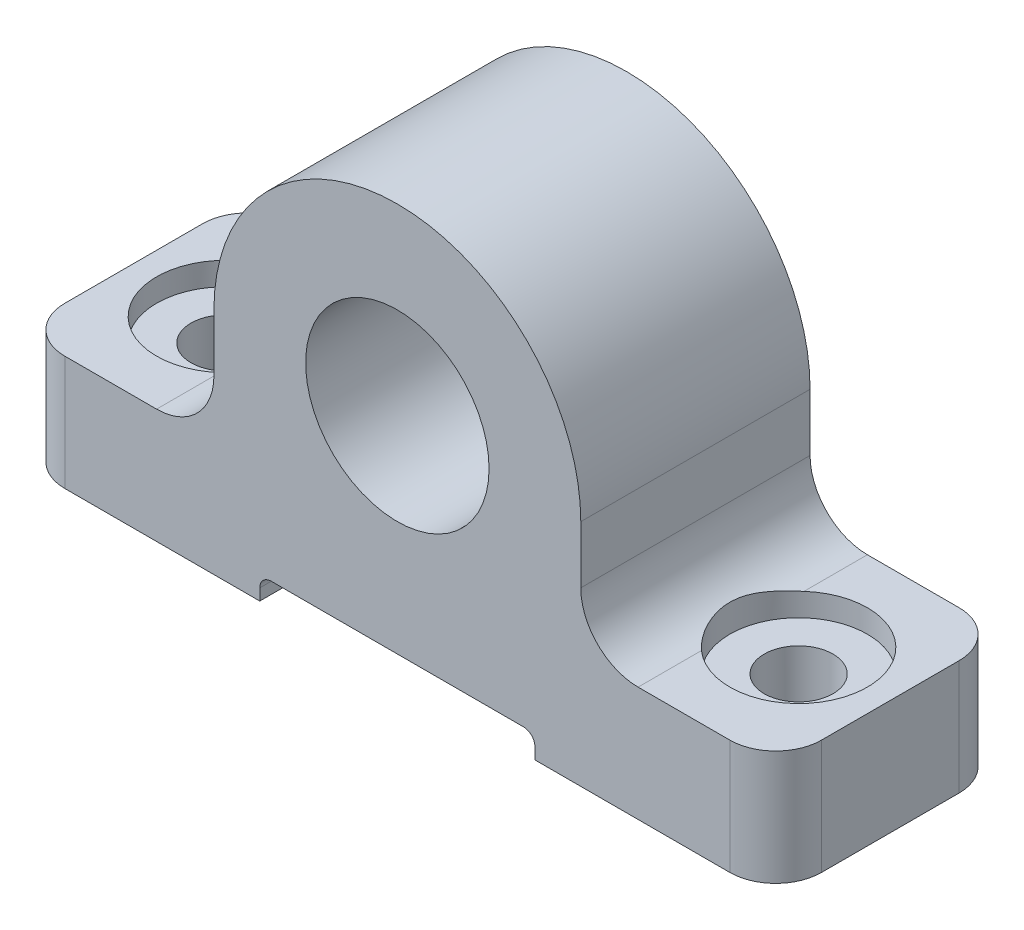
ISO-10303-21;
HEADER;
FILE_DESCRIPTION(('STEP AP214'),'2;1');
FILE_NAME('part.step','',(''),(''),'','','');
FILE_SCHEMA(('AUTOMOTIVE_DESIGN { 1 0 10303 214 1 1 1 1 }'));
ENDSEC;
DATA;
#1=APPLICATION_CONTEXT('core data for automotive mechanical design processes');
#2=APPLICATION_PROTOCOL_DEFINITION('international standard','automotive_design',2000,#1);
#3=PRODUCT_CONTEXT('',#1,'mechanical');
#4=PRODUCT('Part','Part','',(#3));
#5=PRODUCT_RELATED_PRODUCT_CATEGORY('part','',(#4));
#6=PRODUCT_DEFINITION_FORMATION('','',#4);
#7=PRODUCT_DEFINITION_CONTEXT('part definition',#1,'design');
#8=PRODUCT_DEFINITION('design','',#6,#7);
#9=PRODUCT_DEFINITION_SHAPE('','',#8);
#10=(LENGTH_UNIT() NAMED_UNIT(*) SI_UNIT(.MILLI.,.METRE.));
#11=(NAMED_UNIT(*) PLANE_ANGLE_UNIT() SI_UNIT($,.RADIAN.));
#12=(NAMED_UNIT(*) SI_UNIT($,.STERADIAN.) SOLID_ANGLE_UNIT());
#13=UNCERTAINTY_MEASURE_WITH_UNIT(LENGTH_MEASURE(1.E-05),#10,'distance_accuracy_value','');
#14=(GEOMETRIC_REPRESENTATION_CONTEXT(3) GLOBAL_UNCERTAINTY_ASSIGNED_CONTEXT((#13)) GLOBAL_UNIT_ASSIGNED_CONTEXT((#10,
#11,#12)) REPRESENTATION_CONTEXT('',''));
#15=CARTESIAN_POINT('',(0.,0.,0.));
#16=DIRECTION('',(0.,0.,1.));
#17=DIRECTION('',(1.,0.,0.));
#18=AXIS2_PLACEMENT_3D('',#15,#16,#17);
#19=CARTESIAN_POINT('',(25.,-28.7779411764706,0.));
#20=DIRECTION('',(0.,1.,0.));
#21=DIRECTION('',(0.,0.,1.));
#22=AXIS2_PLACEMENT_3D('',#19,#20,#21);
#23=CYLINDRICAL_SURFACE('',#22,3.);
#24=CARTESIAN_POINT('',(25.,-28.7779411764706,0.));
#25=DIRECTION('',(0.,1.,0.));
#26=DIRECTION('',(0.,0.,1.));
#27=AXIS2_PLACEMENT_3D('',#24,#25,#26);
#28=CIRCLE('',#27,3.);
#29=CARTESIAN_POINT('',(25.,-28.7779411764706,3.));
#30=VERTEX_POINT('',#29);
#31=EDGE_CURVE('E289',#30,#30,#28,.T.);
#32=ORIENTED_EDGE('',*,*,#31,.F.);
#33=EDGE_LOOP('',(#32));
#34=FACE_BOUND('',#33,.T.);
#35=CARTESIAN_POINT('',(25.,-20.7779411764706,0.));
#36=DIRECTION('',(0.,1.,0.));
#37=DIRECTION('',(-1.,0.,0.));
#38=AXIS2_PLACEMENT_3D('',#35,#36,#37);
#39=CIRCLE('',#38,3.);
#40=CARTESIAN_POINT('',(22.,-20.7779411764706,0.));
#41=VERTEX_POINT('',#40);
#42=EDGE_CURVE('E200',#41,#41,#39,.F.);
#43=ORIENTED_EDGE('',*,*,#42,.F.);
#44=EDGE_LOOP('',(#43));
#45=FACE_BOUND('',#44,.T.);
#46=ADVANCED_FACE('F32',(#34,#45),#23,.F.);
#47=CARTESIAN_POINT('',(-25.,-28.7779411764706,0.));
#48=DIRECTION('',(0.,1.,0.));
#49=DIRECTION('',(0.,0.,1.));
#50=AXIS2_PLACEMENT_3D('',#47,#48,#49);
#51=CYLINDRICAL_SURFACE('',#50,3.);
#52=CARTESIAN_POINT('',(-25.,-28.7779411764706,0.));
#53=DIRECTION('',(0.,1.,0.));
#54=DIRECTION('',(0.,0.,1.));
#55=AXIS2_PLACEMENT_3D('',#52,#53,#54);
#56=CIRCLE('',#55,3.);
#57=CARTESIAN_POINT('',(-25.,-28.7779411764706,3.));
#58=VERTEX_POINT('',#57);
#59=EDGE_CURVE('E575',#58,#58,#56,.T.);
#60=ORIENTED_EDGE('',*,*,#59,.F.);
#61=EDGE_LOOP('',(#60));
#62=FACE_BOUND('',#61,.T.);
#63=CARTESIAN_POINT('',(-25.,-20.7779411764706,0.));
#64=DIRECTION('',(0.,1.,0.));
#65=DIRECTION('',(-1.,0.,0.));
#66=AXIS2_PLACEMENT_3D('',#63,#64,#65);
#67=CIRCLE('',#66,3.);
#68=CARTESIAN_POINT('',(-28.,-20.7779411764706,0.));
#69=VERTEX_POINT('',#68);
#70=EDGE_CURVE('E248',#69,#69,#67,.F.);
#71=ORIENTED_EDGE('',*,*,#70,.F.);
#72=EDGE_LOOP('',(#71));
#73=FACE_BOUND('',#72,.T.);
#74=ADVANCED_FACE('F323',(#62,#73),#51,.F.);
#75=CARTESIAN_POINT('',(0.,-8.77794117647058,10.));
#76=DIRECTION('',(0.,0.,-1.));
#77=DIRECTION('',(-1.,0.,0.));
#78=AXIS2_PLACEMENT_3D('',#75,#76,#77);
#79=PLANE('',#78);
#80=DIRECTION('',(1.,0.,0.));
#81=VECTOR('',#80,1.);
#82=CARTESIAN_POINT('',(12.,-28.7779411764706,10.));
#83=LINE('',#82,#81);
#84=CARTESIAN_POINT('',(12.,-28.7779411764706,10.));
#85=VERTEX_POINT('',#84);
#86=CARTESIAN_POINT('',(29.,-28.7779411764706,10.));
#87=VERTEX_POINT('',#86);
#88=EDGE_CURVE('E563',#85,#87,#83,.T.);
#89=ORIENTED_EDGE('',*,*,#88,.T.);
#90=DIRECTION('',(0.,1.,0.));
#91=VECTOR('',#90,1.);
#92=CARTESIAN_POINT('',(29.,-8.77794117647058,10.));
#93=LINE('',#92,#91);
#94=CARTESIAN_POINT('',(29.,-18.7779411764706,10.));
#95=VERTEX_POINT('',#94);
#96=EDGE_CURVE('E647',#87,#95,#93,.T.);
#97=ORIENTED_EDGE('',*,*,#96,.T.);
#98=DIRECTION('',(-1.,0.,0.));
#99=VECTOR('',#98,1.);
#100=CARTESIAN_POINT('',(33.,-18.7779411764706,10.));
#101=LINE('',#100,#99);
#102=CARTESIAN_POINT('',(21.,-18.7779411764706,10.));
#103=VERTEX_POINT('',#102);
#104=EDGE_CURVE('E602',#95,#103,#101,.T.);
#105=ORIENTED_EDGE('',*,*,#104,.T.);
#106=CARTESIAN_POINT('',(21.,-13.7779411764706,10.));
#107=DIRECTION('',(0.,0.,-1.));
#108=DIRECTION('',(-1.,0.,0.));
#109=AXIS2_PLACEMENT_3D('',#106,#107,#108);
#110=CIRCLE('',#109,5.);
#111=CARTESIAN_POINT('',(16.,-13.7779411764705,10.));
#112=VERTEX_POINT('',#111);
#113=EDGE_CURVE('E204',#103,#112,#110,.T.);
#114=ORIENTED_EDGE('',*,*,#113,.T.);
#115=DIRECTION('',(0.,1.,0.));
#116=VECTOR('',#115,1.);
#117=CARTESIAN_POINT('',(16.,-13.7779411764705,10.));
#118=LINE('',#117,#116);
#119=CARTESIAN_POINT('',(16.,-8.77794117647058,10.));
#120=VERTEX_POINT('',#119);
#121=EDGE_CURVE('E605',#112,#120,#118,.T.);
#122=ORIENTED_EDGE('',*,*,#121,.T.);
#123=CARTESIAN_POINT('',(0.,-8.77794117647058,10.));
#124=DIRECTION('',(0.,0.,1.));
#125=DIRECTION('',(-1.,0.,0.));
#126=AXIS2_PLACEMENT_3D('',#123,#124,#125);
#127=CIRCLE('',#126,16.);
#128=CARTESIAN_POINT('',(-16.,-8.77794117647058,10.));
#129=VERTEX_POINT('',#128);
#130=EDGE_CURVE('E578',#120,#129,#127,.T.);
#131=ORIENTED_EDGE('',*,*,#130,.T.);
#132=DIRECTION('',(0.,-1.,0.));
#133=VECTOR('',#132,1.);
#134=CARTESIAN_POINT('',(-16.,-13.7779411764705,10.));
#135=LINE('',#134,#133);
#136=CARTESIAN_POINT('',(-16.,-13.7779411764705,10.));
#137=VERTEX_POINT('',#136);
#138=EDGE_CURVE('E581',#129,#137,#135,.T.);
#139=ORIENTED_EDGE('',*,*,#138,.T.);
#140=CARTESIAN_POINT('',(-21.,-13.7779411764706,10.));
#141=DIRECTION('',(0.,0.,-1.));
#142=DIRECTION('',(1.,0.,0.));
#143=AXIS2_PLACEMENT_3D('',#140,#141,#142);
#144=CIRCLE('',#143,5.);
#145=CARTESIAN_POINT('',(-21.,-18.7779411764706,10.));
#146=VERTEX_POINT('',#145);
#147=EDGE_CURVE('E584',#137,#146,#144,.T.);
#148=ORIENTED_EDGE('',*,*,#147,.T.);
#149=DIRECTION('',(-1.,0.,0.));
#150=VECTOR('',#149,1.);
#151=CARTESIAN_POINT('',(-33.,-18.7779411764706,10.));
#152=LINE('',#151,#150);
#153=CARTESIAN_POINT('',(-29.,-18.7779411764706,10.));
#154=VERTEX_POINT('',#153);
#155=EDGE_CURVE('E586',#146,#154,#152,.T.);
#156=ORIENTED_EDGE('',*,*,#155,.T.);
#157=DIRECTION('',(0.,-1.,0.));
#158=VECTOR('',#157,1.);
#159=CARTESIAN_POINT('',(-29.,-8.77794117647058,10.));
#160=LINE('',#159,#158);
#161=CARTESIAN_POINT('',(-29.,-28.7779411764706,10.));
#162=VERTEX_POINT('',#161);
#163=EDGE_CURVE('E668',#154,#162,#160,.T.);
#164=ORIENTED_EDGE('',*,*,#163,.T.);
#165=DIRECTION('',(1.,0.,0.));
#166=VECTOR('',#165,1.);
#167=CARTESIAN_POINT('',(-12.,-28.7779411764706,10.));
#168=LINE('',#167,#166);
#169=CARTESIAN_POINT('',(-12.,-28.7779411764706,10.));
#170=VERTEX_POINT('',#169);
#171=EDGE_CURVE('E589',#162,#170,#168,.T.);
#172=ORIENTED_EDGE('',*,*,#171,.T.);
#173=DIRECTION('',(0.,1.,0.));
#174=VECTOR('',#173,1.);
#175=CARTESIAN_POINT('',(-12.,-27.7779411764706,10.));
#176=LINE('',#175,#174);
#177=CARTESIAN_POINT('',(-12.,-27.7779411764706,10.));
#178=VERTEX_POINT('',#177);
#179=EDGE_CURVE('E591',#170,#178,#176,.T.);
#180=ORIENTED_EDGE('',*,*,#179,.T.);
#181=CARTESIAN_POINT('',(-11.,-27.7779411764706,10.));
#182=DIRECTION('',(0.,0.,-1.));
#183=DIRECTION('',(1.,0.,0.));
#184=AXIS2_PLACEMENT_3D('',#181,#182,#183);
#185=CIRCLE('',#184,1.);
#186=CARTESIAN_POINT('',(-11.,-26.7779411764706,10.));
#187=VERTEX_POINT('',#186);
#188=EDGE_CURVE('E593',#178,#187,#185,.T.);
#189=ORIENTED_EDGE('',*,*,#188,.T.);
#190=DIRECTION('',(1.,0.,0.));
#191=VECTOR('',#190,1.);
#192=CARTESIAN_POINT('',(11.,-26.7779411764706,10.));
#193=LINE('',#192,#191);
#194=CARTESIAN_POINT('',(11.,-26.7779411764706,10.));
#195=VERTEX_POINT('',#194);
#196=EDGE_CURVE('E595',#187,#195,#193,.T.);
#197=ORIENTED_EDGE('',*,*,#196,.T.);
#198=CARTESIAN_POINT('',(11.,-27.7779411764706,10.));
#199=DIRECTION('',(0.,0.,-1.));
#200=DIRECTION('',(-1.,0.,0.));
#201=AXIS2_PLACEMENT_3D('',#198,#199,#200);
#202=CIRCLE('',#201,1.);
#203=CARTESIAN_POINT('',(12.,-27.7779411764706,10.));
#204=VERTEX_POINT('',#203);
#205=EDGE_CURVE('E597',#195,#204,#202,.T.);
#206=ORIENTED_EDGE('',*,*,#205,.T.);
#207=DIRECTION('',(0.,-1.,0.));
#208=VECTOR('',#207,1.);
#209=CARTESIAN_POINT('',(12.,-27.7779411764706,10.));
#210=LINE('',#209,#208);
#211=EDGE_CURVE('E599',#204,#85,#210,.T.);
#212=ORIENTED_EDGE('',*,*,#211,.T.);
#213=EDGE_LOOP('',(#89,#97,#105,#114,#122,#131,#139,#148,#156,#164,#172,#180,#189,#197,#206,#212));
#214=FACE_BOUND('',#213,.T.);
#215=CARTESIAN_POINT('',(0.,-8.77794117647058,10.));
#216=DIRECTION('',(0.,0.,1.));
#217=DIRECTION('',(1.,0.,0.));
#218=AXIS2_PLACEMENT_3D('',#215,#216,#217);
#219=CIRCLE('',#218,8.);
#220=CARTESIAN_POINT('',(8.,-8.77794117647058,10.));
#221=VERTEX_POINT('',#220);
#222=EDGE_CURVE('E567',#221,#221,#219,.T.);
#223=ORIENTED_EDGE('',*,*,#222,.F.);
#224=EDGE_LOOP('',(#223));
#225=FACE_BOUND('',#224,.T.);
#226=ADVANCED_FACE('F328',(#214,#225),#79,.F.);
#227=CARTESIAN_POINT('',(0.,-8.77794117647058,-10.));
#228=DIRECTION('',(0.,0.,-1.));
#229=DIRECTION('',(-1.,0.,0.));
#230=AXIS2_PLACEMENT_3D('',#227,#228,#229);
#231=PLANE('',#230);
#232=DIRECTION('',(-1.,0.,0.));
#233=VECTOR('',#232,1.);
#234=CARTESIAN_POINT('',(33.,-18.7779411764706,-10.));
#235=LINE('',#234,#233);
#236=CARTESIAN_POINT('',(29.,-18.7779411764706,-10.));
#237=VERTEX_POINT('',#236);
#238=CARTESIAN_POINT('',(21.,-18.7779411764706,-10.));
#239=VERTEX_POINT('',#238);
#240=EDGE_CURVE('E629',#237,#239,#235,.T.);
#241=ORIENTED_EDGE('',*,*,#240,.F.);
#242=DIRECTION('',(0.,1.,0.));
#243=VECTOR('',#242,1.);
#244=CARTESIAN_POINT('',(29.,-28.7779411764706,-10.));
#245=LINE('',#244,#243);
#246=CARTESIAN_POINT('',(29.,-28.7779411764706,-10.));
#247=VERTEX_POINT('',#246);
#248=EDGE_CURVE('E663',#237,#247,#245,.F.);
#249=ORIENTED_EDGE('',*,*,#248,.T.);
#250=DIRECTION('',(1.,0.,0.));
#251=VECTOR('',#250,1.);
#252=CARTESIAN_POINT('',(12.,-28.7779411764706,-10.));
#253=LINE('',#252,#251);
#254=CARTESIAN_POINT('',(12.,-28.7779411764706,-10.));
#255=VERTEX_POINT('',#254);
#256=EDGE_CURVE('E626',#255,#247,#253,.T.);
#257=ORIENTED_EDGE('',*,*,#256,.F.);
#258=DIRECTION('',(0.,-1.,0.));
#259=VECTOR('',#258,1.);
#260=CARTESIAN_POINT('',(12.,-27.7779411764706,-10.));
#261=LINE('',#260,#259);
#262=CARTESIAN_POINT('',(12.,-27.7779411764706,-10.));
#263=VERTEX_POINT('',#262);
#264=EDGE_CURVE('E624',#263,#255,#261,.T.);
#265=ORIENTED_EDGE('',*,*,#264,.F.);
#266=CARTESIAN_POINT('',(11.,-27.7779411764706,-10.));
#267=DIRECTION('',(0.,0.,-1.));
#268=DIRECTION('',(-1.,0.,0.));
#269=AXIS2_PLACEMENT_3D('',#266,#267,#268);
#270=CIRCLE('',#269,1.);
#271=CARTESIAN_POINT('',(11.,-26.7779411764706,-10.));
#272=VERTEX_POINT('',#271);
#273=EDGE_CURVE('E622',#272,#263,#270,.T.);
#274=ORIENTED_EDGE('',*,*,#273,.F.);
#275=DIRECTION('',(1.,0.,0.));
#276=VECTOR('',#275,1.);
#277=CARTESIAN_POINT('',(11.,-26.7779411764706,-10.));
#278=LINE('',#277,#276);
#279=CARTESIAN_POINT('',(-11.,-26.7779411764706,-10.));
#280=VERTEX_POINT('',#279);
#281=EDGE_CURVE('E620',#280,#272,#278,.T.);
#282=ORIENTED_EDGE('',*,*,#281,.F.);
#283=CARTESIAN_POINT('',(-11.,-27.7779411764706,-10.));
#284=DIRECTION('',(0.,0.,-1.));
#285=DIRECTION('',(1.,0.,0.));
#286=AXIS2_PLACEMENT_3D('',#283,#284,#285);
#287=CIRCLE('',#286,1.);
#288=CARTESIAN_POINT('',(-12.,-27.7779411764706,-10.));
#289=VERTEX_POINT('',#288);
#290=EDGE_CURVE('E618',#289,#280,#287,.T.);
#291=ORIENTED_EDGE('',*,*,#290,.F.);
#292=DIRECTION('',(0.,1.,0.));
#293=VECTOR('',#292,1.);
#294=CARTESIAN_POINT('',(-12.,-27.7779411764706,-10.));
#295=LINE('',#294,#293);
#296=CARTESIAN_POINT('',(-12.,-28.7779411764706,-10.));
#297=VERTEX_POINT('',#296);
#298=EDGE_CURVE('E616',#297,#289,#295,.T.);
#299=ORIENTED_EDGE('',*,*,#298,.F.);
#300=DIRECTION('',(1.,0.,0.));
#301=VECTOR('',#300,1.);
#302=CARTESIAN_POINT('',(-12.,-28.7779411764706,-10.));
#303=LINE('',#302,#301);
#304=CARTESIAN_POINT('',(-29.,-28.7779411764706,-10.));
#305=VERTEX_POINT('',#304);
#306=EDGE_CURVE('E614',#305,#297,#303,.T.);
#307=ORIENTED_EDGE('',*,*,#306,.F.);
#308=DIRECTION('',(0.,-1.,0.));
#309=VECTOR('',#308,1.);
#310=CARTESIAN_POINT('',(-29.,-18.7779411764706,-10.));
#311=LINE('',#310,#309);
#312=CARTESIAN_POINT('',(-29.,-18.7779411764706,-10.));
#313=VERTEX_POINT('',#312);
#314=EDGE_CURVE('E661',#305,#313,#311,.F.);
#315=ORIENTED_EDGE('',*,*,#314,.T.);
#316=DIRECTION('',(-1.,0.,0.));
#317=VECTOR('',#316,1.);
#318=CARTESIAN_POINT('',(-33.,-18.7779411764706,-10.));
#319=LINE('',#318,#317);
#320=CARTESIAN_POINT('',(-21.,-18.7779411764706,-10.));
#321=VERTEX_POINT('',#320);
#322=EDGE_CURVE('E612',#321,#313,#319,.T.);
#323=ORIENTED_EDGE('',*,*,#322,.F.);
#324=CARTESIAN_POINT('',(-21.,-13.7779411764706,-10.));
#325=DIRECTION('',(0.,0.,-1.));
#326=DIRECTION('',(1.,0.,0.));
#327=AXIS2_PLACEMENT_3D('',#324,#325,#326);
#328=CIRCLE('',#327,5.);
#329=CARTESIAN_POINT('',(-16.,-13.7779411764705,-10.));
#330=VERTEX_POINT('',#329);
#331=EDGE_CURVE('E609',#330,#321,#328,.T.);
#332=ORIENTED_EDGE('',*,*,#331,.F.);
#333=DIRECTION('',(0.,-1.,0.));
#334=VECTOR('',#333,1.);
#335=CARTESIAN_POINT('',(-16.,-13.7779411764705,-10.));
#336=LINE('',#335,#334);
#337=CARTESIAN_POINT('',(-16.,-8.77794117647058,-10.));
#338=VERTEX_POINT('',#337);
#339=EDGE_CURVE('E572',#338,#330,#336,.T.);
#340=ORIENTED_EDGE('',*,*,#339,.F.);
#341=CARTESIAN_POINT('',(0.,-8.77794117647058,-10.));
#342=DIRECTION('',(0.,0.,1.));
#343=DIRECTION('',(-1.,0.,0.));
#344=AXIS2_PLACEMENT_3D('',#341,#342,#343);
#345=CIRCLE('',#344,16.);
#346=CARTESIAN_POINT('',(16.,-8.77794117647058,-10.));
#347=VERTEX_POINT('',#346);
#348=EDGE_CURVE('E568',#347,#338,#345,.T.);
#349=ORIENTED_EDGE('',*,*,#348,.F.);
#350=DIRECTION('',(0.,1.,0.));
#351=VECTOR('',#350,1.);
#352=CARTESIAN_POINT('',(16.,-13.7779411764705,-10.));
#353=LINE('',#352,#351);
#354=CARTESIAN_POINT('',(16.,-13.7779411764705,-10.));
#355=VERTEX_POINT('',#354);
#356=EDGE_CURVE('E582',#355,#347,#353,.T.);
#357=ORIENTED_EDGE('',*,*,#356,.F.);
#358=CARTESIAN_POINT('',(21.,-13.7779411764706,-10.));
#359=DIRECTION('',(0.,0.,-1.));
#360=DIRECTION('',(-1.,0.,0.));
#361=AXIS2_PLACEMENT_3D('',#358,#359,#360);
#362=CIRCLE('',#361,5.);
#363=EDGE_CURVE('E631',#239,#355,#362,.T.);
#364=ORIENTED_EDGE('',*,*,#363,.F.);
#365=EDGE_LOOP('',(#241,#249,#257,#265,#274,#282,#291,#299,#307,#315,#323,#332,#340,#349,#357,#364));
#366=FACE_BOUND('',#365,.T.);
#367=CARTESIAN_POINT('',(0.,-8.77794117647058,-10.));
#368=DIRECTION('',(0.,0.,1.));
#369=DIRECTION('',(1.,0.,0.));
#370=AXIS2_PLACEMENT_3D('',#367,#368,#369);
#371=CIRCLE('',#370,8.);
#372=CARTESIAN_POINT('',(8.,-8.77794117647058,-10.));
#373=VERTEX_POINT('',#372);
#374=EDGE_CURVE('E569',#373,#373,#371,.T.);
#375=ORIENTED_EDGE('',*,*,#374,.T.);
#376=EDGE_LOOP('',(#375));
#377=FACE_BOUND('',#376,.T.);
#378=ADVANCED_FACE('F306',(#366,#377),#231,.T.);
#379=CARTESIAN_POINT('',(0.,-8.77794117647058,10.));
#380=DIRECTION('',(0.,0.,-1.));
#381=DIRECTION('',(-1.,0.,0.));
#382=AXIS2_PLACEMENT_3D('',#379,#380,#381);
#383=CYLINDRICAL_SURFACE('',#382,16.);
#384=ORIENTED_EDGE('',*,*,#348,.T.);
#385=DIRECTION('',(0.,0.,-1.));
#386=VECTOR('',#385,1.);
#387=CARTESIAN_POINT('',(-16.,-8.77794117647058,10.));
#388=LINE('',#387,#386);
#389=EDGE_CURVE('E245',#129,#338,#388,.T.);
#390=ORIENTED_EDGE('',*,*,#389,.F.);
#391=ORIENTED_EDGE('',*,*,#130,.F.);
#392=DIRECTION('',(0.,0.,-1.));
#393=VECTOR('',#392,1.);
#394=CARTESIAN_POINT('',(16.,-8.77794117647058,10.));
#395=LINE('',#394,#393);
#396=EDGE_CURVE('E606',#120,#347,#395,.T.);
#397=ORIENTED_EDGE('',*,*,#396,.T.);
#398=EDGE_LOOP('',(#384,#390,#391,#397));
#399=FACE_BOUND('',#398,.T.);
#400=ADVANCED_FACE('F302',(#399),#383,.T.);
#401=CARTESIAN_POINT('',(-16.,-13.7779411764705,10.));
#402=DIRECTION('',(1.,0.,0.));
#403=DIRECTION('',(0.,0.,-1.));
#404=AXIS2_PLACEMENT_3D('',#401,#402,#403);
#405=PLANE('',#404);
#406=ORIENTED_EDGE('',*,*,#339,.T.);
#407=DIRECTION('',(0.,0.,-1.));
#408=VECTOR('',#407,1.);
#409=CARTESIAN_POINT('',(-16.,-13.7779411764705,10.));
#410=LINE('',#409,#408);
#411=EDGE_CURVE('E242',#137,#330,#410,.T.);
#412=ORIENTED_EDGE('',*,*,#411,.F.);
#413=ORIENTED_EDGE('',*,*,#138,.F.);
#414=ORIENTED_EDGE('',*,*,#389,.T.);
#415=EDGE_LOOP('',(#406,#412,#413,#414));
#416=FACE_BOUND('',#415,.T.);
#417=ADVANCED_FACE('F297',(#416),#405,.F.);
#418=CARTESIAN_POINT('',(-21.,-13.7779411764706,10.));
#419=DIRECTION('',(0.,0.,-1.));
#420=DIRECTION('',(-1.,0.,0.));
#421=AXIS2_PLACEMENT_3D('',#418,#419,#420);
#422=CYLINDRICAL_SURFACE('',#421,5.);
#423=DIRECTION('',(0.,0.,-1.));
#424=VECTOR('',#423,1.);
#425=CARTESIAN_POINT('',(-21.,-18.7779411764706,10.));
#426=LINE('',#425,#424);
#427=CARTESIAN_POINT('',(-21.,-18.7779411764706,-4.47213595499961));
#428=VERTEX_POINT('',#427);
#429=EDGE_CURVE('E238',#428,#321,#426,.T.);
#430=ORIENTED_EDGE('',*,*,#429,.F.);
#431=CARTESIAN_POINT('',(-26.,-13.7779411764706,5.91607978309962));
#432=CARTESIAN_POINT('',(-26.0000004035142,-13.6376815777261,5.91607930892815));
#433=CARTESIAN_POINT('',(-25.9940946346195,-13.4974273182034,5.91708696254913));
#434=CARTESIAN_POINT('',(-25.970519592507,-13.2179413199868,5.92099949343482));
#435=CARTESIAN_POINT('',(-25.9528507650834,-13.0787095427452,5.92390429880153));
#436=CARTESIAN_POINT('',(-25.9058850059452,-12.8022611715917,5.93126762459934));
#437=CARTESIAN_POINT('',(-25.8765877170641,-12.665044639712,5.93572619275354));
#438=CARTESIAN_POINT('',(-25.8065809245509,-12.3935902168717,5.94564339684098));
#439=CARTESIAN_POINT('',(-25.7658712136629,-12.2593523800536,5.95110205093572));
#440=CARTESIAN_POINT('',(-25.6733501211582,-11.9948484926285,5.96227874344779));
#441=CARTESIAN_POINT('',(-25.6215444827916,-11.8645804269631,5.96799664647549));
#442=CARTESIAN_POINT('',(-25.5071494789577,-11.6087847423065,5.97880417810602));
#443=CARTESIAN_POINT('',(-25.4445563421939,-11.4832587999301,5.98389358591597));
#444=CARTESIAN_POINT('',(-25.3090095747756,-11.2378449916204,5.99242214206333));
#445=CARTESIAN_POINT('',(-25.2360545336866,-11.1179578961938,5.99586106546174));
#446=CARTESIAN_POINT('',(-25.0803027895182,-10.8847090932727,5.99996812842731));
#447=CARTESIAN_POINT('',(-24.9975067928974,-10.7713469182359,6.0006364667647));
#448=CARTESIAN_POINT('',(-24.8230689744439,-10.5524735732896,5.99802208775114));
#449=CARTESIAN_POINT('',(-24.7314665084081,-10.4469308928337,5.99475625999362));
#450=CARTESIAN_POINT('',(-24.5399430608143,-10.2440696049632,5.98310481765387));
#451=CARTESIAN_POINT('',(-24.4400262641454,-10.1467469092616,5.97472176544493));
#452=CARTESIAN_POINT('',(-24.2328961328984,-9.96117554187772,5.95167186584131));
#453=CARTESIAN_POINT('',(-24.1256887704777,-9.87291958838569,5.93701011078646));
#454=CARTESIAN_POINT('',(-23.905122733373,-9.70616437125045,5.90031630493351));
#455=CARTESIAN_POINT('',(-23.7917649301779,-9.62766373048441,5.87828529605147));
#456=CARTESIAN_POINT('',(-23.5720248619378,-9.48843495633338,5.82857330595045));
#457=CARTESIAN_POINT('',(-23.4660916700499,-9.42671291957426,5.80168595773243));
#458=CARTESIAN_POINT('',(-23.2516257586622,-9.31196226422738,5.74069772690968));
#459=CARTESIAN_POINT('',(-23.1430932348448,-9.2589329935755,5.70659738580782));
#460=CARTESIAN_POINT('',(-22.9247572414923,-9.16171030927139,5.6308714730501));
#461=CARTESIAN_POINT('',(-22.8149542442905,-9.11751371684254,5.58924861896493));
#462=CARTESIAN_POINT('',(-22.5953569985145,-9.03784858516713,5.49834612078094));
#463=CARTESIAN_POINT('',(-22.4855627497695,-9.00237974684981,5.44906673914));
#464=CARTESIAN_POINT('',(-22.2765621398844,-8.94253187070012,5.34744983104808));
#465=CARTESIAN_POINT('',(-22.1772503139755,-8.91746568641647,5.29573004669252));
#466=CARTESIAN_POINT('',(-21.980562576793,-8.87399945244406,5.18610422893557));
#467=CARTESIAN_POINT('',(-21.8831873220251,-8.8556016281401,5.12819613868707));
#468=CARTESIAN_POINT('',(-21.6912210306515,-8.82499650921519,5.00648550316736));
#469=CARTESIAN_POINT('',(-21.5966295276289,-8.81278817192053,4.94268395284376));
#470=CARTESIAN_POINT('',(-21.4108544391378,-8.79397481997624,4.80948091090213));
#471=CARTESIAN_POINT('',(-21.319672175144,-8.78737195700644,4.74007728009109));
#472=CARTESIAN_POINT('',(-21.1345321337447,-8.77882850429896,4.59057341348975));
#473=CARTESIAN_POINT('',(-21.0408889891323,-8.77727982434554,4.51006112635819));
#474=CARTESIAN_POINT('',(-20.8587602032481,-8.77910605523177,4.34343065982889));
#475=CARTESIAN_POINT('',(-20.7702764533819,-8.78248276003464,4.25731044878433));
#476=CARTESIAN_POINT('',(-20.5132260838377,-8.79873222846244,3.99119221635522));
#477=CARTESIAN_POINT('',(-20.3530088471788,-8.8177228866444,3.80339494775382));
#478=CARTESIAN_POINT('',(-20.0281625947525,-8.87001422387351,3.37159940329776));
#479=CARTESIAN_POINT('',(-19.8689227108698,-8.90540164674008,3.12383005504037));
#480=CARTESIAN_POINT('',(-19.5883425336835,-8.97915711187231,2.60772678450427));
#481=CARTESIAN_POINT('',(-19.4670384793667,-9.01752796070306,2.33937350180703));
#482=CARTESIAN_POINT('',(-19.3077794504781,-9.07260999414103,1.90454022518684));
#483=CARTESIAN_POINT('',(-19.2563030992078,-9.09160055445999,1.74318059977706));
#484=CARTESIAN_POINT('',(-19.1670836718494,-9.12576811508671,1.41625386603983));
#485=CARTESIAN_POINT('',(-19.1293416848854,-9.1409448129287,1.25068642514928));
#486=CARTESIAN_POINT('',(-19.0680162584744,-9.16615851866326,0.916717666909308));
#487=CARTESIAN_POINT('',(-19.0444199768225,-9.17620018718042,0.748319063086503));
#488=CARTESIAN_POINT('',(-19.0116035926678,-9.1902833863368,0.409880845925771));
#489=CARTESIAN_POINT('',(-19.0023820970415,-9.19432549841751,0.239841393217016));
#490=CARTESIAN_POINT('',(-18.9985351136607,-9.1960051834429,-0.0911908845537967));
#491=CARTESIAN_POINT('',(-19.0031444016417,-9.19397853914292,-0.252173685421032));
#492=CARTESIAN_POINT('',(-19.0252660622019,-9.18440543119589,-0.573080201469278));
#493=CARTESIAN_POINT('',(-19.042778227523,-9.17685905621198,-0.733003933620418));
#494=CARTESIAN_POINT('',(-19.0905281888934,-9.15683913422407,-1.0506954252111));
#495=CARTESIAN_POINT('',(-19.1207720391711,-9.14436324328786,-1.20846212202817));
#496=CARTESIAN_POINT('',(-19.1936994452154,-9.11545114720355,-1.52071784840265));
#497=CARTESIAN_POINT('',(-19.2363833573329,-9.09901482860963,-1.67520678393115));
#498=CARTESIAN_POINT('',(-19.3331451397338,-9.06368563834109,-1.97778192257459));
#499=CARTESIAN_POINT('',(-19.3870492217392,-9.04483174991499,-2.12592842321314));
#500=CARTESIAN_POINT('',(-19.5062973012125,-9.00585706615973,-2.41744571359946));
#501=CARTESIAN_POINT('',(-19.571646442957,-8.98573570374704,-2.56081432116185));
#502=CARTESIAN_POINT('',(-19.7134905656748,-8.94572360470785,-2.84212109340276));
#503=CARTESIAN_POINT('',(-19.7899951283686,-8.92583308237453,-2.98005445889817));
#504=CARTESIAN_POINT('',(-19.95375125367,-8.88790784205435,-3.24965353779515));
#505=CARTESIAN_POINT('',(-20.0410024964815,-8.86987306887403,-3.38131943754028));
#506=CARTESIAN_POINT('',(-20.2332041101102,-8.83605026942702,-3.64784120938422));
#507=CARTESIAN_POINT('',(-20.33900974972,-8.82055436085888,-3.78212019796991));
#508=CARTESIAN_POINT('',(-20.5620541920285,-8.79589442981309,-4.04152106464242));
#509=CARTESIAN_POINT('',(-20.6792946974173,-8.7867313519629,-4.16664157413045));
#510=CARTESIAN_POINT('',(-20.923977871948,-8.77702372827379,-4.40627908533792));
#511=CARTESIAN_POINT('',(-21.0513956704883,-8.7764587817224,-4.52082054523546));
#512=CARTESIAN_POINT('',(-21.3153082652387,-8.78614941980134,-4.73837981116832));
#513=CARTESIAN_POINT('',(-21.4517980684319,-8.79639909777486,-4.84140387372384));
#514=CARTESIAN_POINT('',(-21.68864390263,-8.82463128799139,-5.00487500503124));
#515=CARTESIAN_POINT('',(-21.7871307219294,-8.83924501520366,-5.0686404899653));
#516=CARTESIAN_POINT('',(-21.9867485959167,-8.87522726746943,-5.18979122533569));
#517=CARTESIAN_POINT('',(-22.0878789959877,-8.8965941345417,-5.24717803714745));
#518=CARTESIAN_POINT('',(-22.2918283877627,-8.94656497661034,-5.3552891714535));
#519=CARTESIAN_POINT('',(-22.3946464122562,-8.97516493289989,-5.40601716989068));
#520=CARTESIAN_POINT('',(-22.6010142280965,-9.03996182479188,-5.50070495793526));
#521=CARTESIAN_POINT('',(-22.7045640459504,-9.07615903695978,-5.54466450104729));
#522=CARTESIAN_POINT('',(-22.9115183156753,-9.15642194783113,-5.6258890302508));
#523=CARTESIAN_POINT('',(-23.0149220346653,-9.20050362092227,-5.6631401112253));
#524=CARTESIAN_POINT('',(-23.2202624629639,-9.29650395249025,-5.73098838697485));
#525=CARTESIAN_POINT('',(-23.3221991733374,-9.34842260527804,-5.76158558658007));
#526=CARTESIAN_POINT('',(-23.5235644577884,-9.45997011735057,-5.81644502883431));
#527=CARTESIAN_POINT('',(-23.6229922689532,-9.51960128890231,-5.84070536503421));
#528=CARTESIAN_POINT('',(-23.8183170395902,-9.64627790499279,-5.88333412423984));
#529=CARTESIAN_POINT('',(-23.9142139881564,-9.71332337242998,-5.90170252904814));
#530=CARTESIAN_POINT('',(-24.0992861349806,-9.85270135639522,-5.9327312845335));
#531=CARTESIAN_POINT('',(-24.1885688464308,-9.92486241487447,-5.94552139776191));
#532=CARTESIAN_POINT('',(-24.362260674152,-10.0754502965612,-5.96665325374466));
#533=CARTESIAN_POINT('',(-24.4466680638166,-10.1538793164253,-5.97499342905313));
#534=CARTESIAN_POINT('',(-24.6916264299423,-10.3978680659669,-5.99430663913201));
#535=CARTESIAN_POINT('',(-24.8440280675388,-10.5722155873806,-5.99958971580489));
#536=CARTESIAN_POINT('',(-25.1370587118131,-10.9584861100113,-6.00040404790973));
#537=CARTESIAN_POINT('',(-25.2750137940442,-11.1724213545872,-5.99491430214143));
#538=CARTESIAN_POINT('',(-25.5168954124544,-11.6187645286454,-5.97892718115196));
#539=CARTESIAN_POINT('',(-25.6208058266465,-11.8511811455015,-5.96842743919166));
#540=CARTESIAN_POINT('',(-25.7534018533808,-12.2208413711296,-5.95269460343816));
#541=CARTESIAN_POINT('',(-25.794862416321,-12.3536358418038,-5.94722552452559));
#542=CARTESIAN_POINT('',(-25.8665976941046,-12.6222874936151,-5.93719916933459));
#543=CARTESIAN_POINT('',(-25.8968717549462,-12.7581448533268,-5.93264194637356));
#544=CARTESIAN_POINT('',(-25.9459900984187,-13.0319315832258,-5.92500791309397));
#545=CARTESIAN_POINT('',(-25.9648354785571,-13.1698607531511,-5.92193096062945));
#546=CARTESIAN_POINT('',(-25.9909636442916,-13.4468390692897,-5.91761505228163));
#547=CARTESIAN_POINT('',(-25.9982466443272,-13.5858881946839,-5.91637606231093));
#548=CARTESIAN_POINT('',(-26.0011992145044,-13.8647188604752,-5.91587715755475));
#549=CARTESIAN_POINT('',(-25.9968180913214,-14.0045009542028,-5.91662588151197));
#550=CARTESIAN_POINT('',(-25.9763691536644,-14.2831847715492,-5.92003463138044));
#551=CARTESIAN_POINT('',(-25.9603012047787,-14.4220864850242,-5.92269467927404));
#552=CARTESIAN_POINT('',(-25.9165974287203,-14.6980443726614,-5.92961528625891));
#553=CARTESIAN_POINT('',(-25.8889592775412,-14.8351001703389,-5.93387616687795));
#554=CARTESIAN_POINT('',(-25.8223186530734,-15.1063808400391,-5.94347740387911));
#555=CARTESIAN_POINT('',(-25.7833161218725,-15.2406056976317,-5.94881776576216));
#556=CARTESIAN_POINT('',(-25.6943082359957,-15.5050472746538,-5.95986084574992));
#557=CARTESIAN_POINT('',(-25.6443245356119,-15.6352713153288,-5.96556283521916));
#558=CARTESIAN_POINT('',(-25.5336274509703,-15.8911522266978,-5.97648176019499));
#559=CARTESIAN_POINT('',(-25.4729103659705,-16.0168075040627,-5.98169852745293));
#560=CARTESIAN_POINT('',(-25.3411517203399,-16.2626655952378,-5.99065725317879));
#561=CARTESIAN_POINT('',(-25.2701087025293,-16.3828676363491,-5.99439900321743));
#562=CARTESIAN_POINT('',(-25.1181941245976,-16.6169448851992,-5.9993168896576));
#563=CARTESIAN_POINT('',(-25.0373231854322,-16.7308204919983,-6.00049318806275));
#564=CARTESIAN_POINT('',(-24.8661361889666,-16.9516702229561,-5.99911846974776));
#565=CARTESIAN_POINT('',(-24.7757976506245,-17.0586268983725,-5.99655838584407));
#566=CARTESIAN_POINT('',(-24.5866356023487,-17.2644244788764,-5.98649250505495));
#567=CARTESIAN_POINT('',(-24.4878162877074,-17.3632693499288,-5.97898914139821));
#568=CARTESIAN_POINT('',(-24.282680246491,-17.5519863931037,-5.95785806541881));
#569=CARTESIAN_POINT('',(-24.1763692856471,-17.6418653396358,-5.9442350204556));
#570=CARTESIAN_POINT('',(-23.9573683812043,-17.8119447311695,-5.90975438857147));
#571=CARTESIAN_POINT('',(-23.8446793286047,-17.8921465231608,-5.88889781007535));
#572=CARTESIAN_POINT('',(-23.6255733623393,-18.0349074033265,-5.84142656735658));
#573=CARTESIAN_POINT('',(-23.5196150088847,-18.098424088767,-5.81557086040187));
#574=CARTESIAN_POINT('',(-23.3048597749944,-18.2167072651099,-5.75663893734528));
#575=CARTESIAN_POINT('',(-23.1960631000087,-18.271474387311,-5.72356324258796));
#576=CARTESIAN_POINT('',(-22.9769767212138,-18.3720775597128,-5.64984327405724));
#577=CARTESIAN_POINT('',(-22.8666876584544,-18.4179173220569,-5.60920215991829));
#578=CARTESIAN_POINT('',(-22.6459129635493,-18.5007443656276,-5.52018447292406));
#579=CARTESIAN_POINT('',(-22.5354273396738,-18.5377320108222,-5.47180821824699));
#580=CARTESIAN_POINT('',(-22.3254255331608,-18.6001973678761,-5.37205108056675));
#581=CARTESIAN_POINT('',(-22.2258134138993,-18.6264093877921,-5.32132769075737));
#582=CARTESIAN_POINT('',(-22.028387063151,-18.6720896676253,-5.2136515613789));
#583=CARTESIAN_POINT('',(-21.9305734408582,-18.6915556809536,-5.15669675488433));
#584=CARTESIAN_POINT('',(-21.7376125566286,-18.7242027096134,-5.03683705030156));
#585=CARTESIAN_POINT('',(-21.6424648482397,-18.7373847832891,-4.97393315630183));
#586=CARTESIAN_POINT('',(-21.4554800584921,-18.7580406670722,-4.84246310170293));
#587=CARTESIAN_POINT('',(-21.3636442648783,-18.7655122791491,-4.77389477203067));
#588=CARTESIAN_POINT('',(-21.1776796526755,-18.775709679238,-4.62654209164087));
#589=CARTESIAN_POINT('',(-21.0838308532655,-18.7780718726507,-4.54737921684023));
#590=CARTESIAN_POINT('',(-20.9011561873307,-18.7777992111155,-4.38344198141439));
#591=CARTESIAN_POINT('',(-20.8123321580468,-18.7751625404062,-4.29866559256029));
#592=CARTESIAN_POINT('',(-20.5540810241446,-18.7609996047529,-4.03656880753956));
#593=CARTESIAN_POINT('',(-20.3928167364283,-18.7432225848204,-3.85143466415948));
#594=CARTESIAN_POINT('',(-20.065550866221,-18.6931586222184,-3.42589831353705));
#595=CARTESIAN_POINT('',(-19.9047739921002,-18.6587160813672,-3.18176334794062));
#596=CARTESIAN_POINT('',(-19.6203499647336,-18.5860768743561,-2.67289051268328));
#597=CARTESIAN_POINT('',(-19.496740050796,-18.5478764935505,-2.40813231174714));
#598=CARTESIAN_POINT('',(-19.3328710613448,-18.4922462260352,-1.97791950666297));
#599=CARTESIAN_POINT('',(-19.279436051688,-18.4728459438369,-1.81761998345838));
#600=CARTESIAN_POINT('',(-19.1861802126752,-18.4376145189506,-1.4926657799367));
#601=CARTESIAN_POINT('',(-19.1463605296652,-18.4217836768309,-1.32801073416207));
#602=CARTESIAN_POINT('',(-19.0807701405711,-18.3950628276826,-0.995681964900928));
#603=CARTESIAN_POINT('',(-19.0549868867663,-18.3841684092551,-0.828011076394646));
#604=CARTESIAN_POINT('',(-19.0177041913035,-18.3682483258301,-0.490814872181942));
#605=CARTESIAN_POINT('',(-19.0062033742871,-18.3632220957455,-0.32128973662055));
#606=CARTESIAN_POINT('',(-18.9978335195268,-18.359572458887,0.00994309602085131));
#607=CARTESIAN_POINT('',(-19.0002810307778,-18.3606499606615,0.171630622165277));
#608=CARTESIAN_POINT('',(-19.0182021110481,-18.3684283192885,0.49414244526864));
#609=CARTESIAN_POINT('',(-19.0336755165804,-18.3751291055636,0.654966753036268));
#610=CARTESIAN_POINT('',(-19.0774870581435,-18.3936216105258,0.974617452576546));
#611=CARTESIAN_POINT('',(-19.1058306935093,-18.4054155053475,1.13344296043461));
#612=CARTESIAN_POINT('',(-19.1751068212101,-18.4331698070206,1.4479470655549));
#613=CARTESIAN_POINT('',(-19.2160396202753,-18.4491303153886,1.60362558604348));
#614=CARTESIAN_POINT('',(-19.3091448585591,-18.4836203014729,1.9075879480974));
#615=CARTESIAN_POINT('',(-19.361057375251,-18.5020873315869,2.05595877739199));
#616=CARTESIAN_POINT('',(-19.4763030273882,-18.5405073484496,2.34807088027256));
#617=CARTESIAN_POINT('',(-19.5396412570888,-18.5604609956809,2.49181005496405));
#618=CARTESIAN_POINT('',(-19.6774473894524,-18.600389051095,2.7740063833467));
#619=CARTESIAN_POINT('',(-19.7519249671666,-18.6203634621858,2.9124588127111));
#620=CARTESIAN_POINT('',(-19.9116200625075,-18.6587373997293,3.1832526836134));
#621=CARTESIAN_POINT('',(-19.9968373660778,-18.6771369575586,3.31559424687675));
#622=CARTESIAN_POINT('',(-20.1851151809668,-18.7120948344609,3.58412407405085));
#623=CARTESIAN_POINT('',(-20.2890684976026,-18.7283750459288,3.71972534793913));
#624=CARTESIAN_POINT('',(-20.508521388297,-18.7549546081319,3.98193993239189));
#625=CARTESIAN_POINT('',(-20.6240227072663,-18.7652530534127,4.10855187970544));
#626=CARTESIAN_POINT('',(-20.8654084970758,-18.7775867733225,4.35136649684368));
#627=CARTESIAN_POINT('',(-20.9912687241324,-18.7796408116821,4.46759221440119));
#628=CARTESIAN_POINT('',(-21.2523080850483,-18.7732746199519,4.68871158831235));
#629=CARTESIAN_POINT('',(-21.3874822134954,-18.7648599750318,4.79361125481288));
#630=CARTESIAN_POINT('',(-21.6228424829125,-18.7399449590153,4.96072788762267));
#631=CARTESIAN_POINT('',(-21.7210890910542,-18.726703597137,5.02618846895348));
#632=CARTESIAN_POINT('',(-21.9204387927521,-18.6935280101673,5.15073799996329));
#633=CARTESIAN_POINT('',(-22.0215411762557,-18.673595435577,5.20982851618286));
#634=CARTESIAN_POINT('',(-22.2256580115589,-18.6265208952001,5.32132919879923));
#635=CARTESIAN_POINT('',(-22.3286713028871,-18.5993831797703,5.37374327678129));
#636=CARTESIAN_POINT('',(-22.5356617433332,-18.5375010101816,5.47175924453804));
#637=CARTESIAN_POINT('',(-22.6396389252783,-18.5027562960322,5.51736090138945));
#638=CARTESIAN_POINT('',(-22.8477150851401,-18.4253382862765,5.60181291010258));
#639=CARTESIAN_POINT('',(-22.9518137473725,-18.3826459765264,5.64064662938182));
#640=CARTESIAN_POINT('',(-23.1587538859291,-18.2893338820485,5.71154769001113));
#641=CARTESIAN_POINT('',(-23.2615953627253,-18.2387141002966,5.74361503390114));
#642=CARTESIAN_POINT('',(-23.4649512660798,-18.129645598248,5.80127574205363));
#643=CARTESIAN_POINT('',(-23.5654650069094,-18.0711946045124,5.82686722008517));
#644=CARTESIAN_POINT('',(-23.7631089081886,-17.9467383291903,5.87199950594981));
#645=CARTESIAN_POINT('',(-23.8602390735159,-17.8807330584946,5.8915403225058));
#646=CARTESIAN_POINT('',(-24.0471944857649,-17.7437453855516,5.9246001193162));
#647=CARTESIAN_POINT('',(-24.1371536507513,-17.6729867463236,5.93829017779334));
#648=CARTESIAN_POINT('',(-24.3123448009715,-17.5251446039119,5.96111925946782));
#649=CARTESIAN_POINT('',(-24.3975751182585,-17.4480588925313,5.97025668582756));
#650=CARTESIAN_POINT('',(-24.6451845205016,-17.2080079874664,5.99178833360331));
#651=CARTESIAN_POINT('',(-24.7996103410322,-17.0361551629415,5.99832257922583));
#652=CARTESIAN_POINT('',(-25.0967431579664,-16.6555323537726,6.00123806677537));
#653=CARTESIAN_POINT('',(-25.2369290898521,-16.4448047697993,5.99659189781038));
#654=CARTESIAN_POINT('',(-25.4839572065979,-16.0045571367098,5.9817353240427));
#655=CARTESIAN_POINT('',(-25.590774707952,-15.7750233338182,5.97152081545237));
#656=CARTESIAN_POINT('',(-25.732445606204,-15.3985876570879,5.95535919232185));
#657=CARTESIAN_POINT('',(-25.7789136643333,-15.2559402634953,5.94936197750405));
#658=CARTESIAN_POINT('',(-25.8588770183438,-14.9669611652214,5.93834771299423));
#659=CARTESIAN_POINT('',(-25.892370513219,-14.8206289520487,5.93333079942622));
#660=CARTESIAN_POINT('',(-25.9460712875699,-14.5255223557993,5.92500516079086));
#661=CARTESIAN_POINT('',(-25.9662800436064,-14.3767482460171,5.92169624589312));
#662=CARTESIAN_POINT('',(-25.9932435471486,-14.0779610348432,5.9172339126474));
#663=CARTESIAN_POINT('',(-25.9999995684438,-13.9279480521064,5.91608029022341));
#664=CARTESIAN_POINT('',(-26.,-13.7779411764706,5.91607978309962));
#665=B_SPLINE_CURVE_WITH_KNOTS('',3,(#431,#432,#433,#434,#435,#436,#437,#438,#439,#440,#441,
#442,#443,#444,#445,#446,#447,#448,#449,#450,#451,#452,#453,#454,#455,#456,#457,#458,#459,#460,
#461,#462,#463,#464,#465,#466,#467,#468,#469,#470,#471,#472,#473,#474,#475,#476,#477,#478,#479,
#480,#481,#482,#483,#484,#485,#486,#487,#488,#489,#490,#491,#492,#493,#494,#495,#496,#497,#498,
#499,#500,#501,#502,#503,#504,#505,#506,#507,#508,#509,#510,#511,#512,#513,#514,#515,#516,#517,
#518,#519,#520,#521,#522,#523,#524,#525,#526,#527,#528,#529,#530,#531,#532,#533,#534,#535,#536,
#537,#538,#539,#540,#541,#542,#543,#544,#545,#546,#547,#548,#549,#550,#551,#552,#553,#554,#555,
#556,#557,#558,#559,#560,#561,#562,#563,#564,#565,#566,#567,#568,#569,#570,#571,#572,#573,#574,
#575,#576,#577,#578,#579,#580,#581,#582,#583,#584,#585,#586,#587,#588,#589,#590,#591,#592,#593,
#594,#595,#596,#597,#598,#599,#600,#601,#602,#603,#604,#605,#606,#607,#608,#609,#610,#611,#612,
#613,#614,#615,#616,#617,#618,#619,#620,#621,#622,#623,#624,#625,#626,#627,#628,#629,#630,#631,
#632,#633,#634,#635,#636,#637,#638,#639,#640,#641,#642,#643,#644,#645,#646,#647,#648,#649,#650,
#651,#652,#653,#654,#655,#656,#657,#658,#659,#660,#661,#662,#663,#664),.UNSPECIFIED.,.T.,.F.,(4,
2,2,2,2,2,2,2,2,2,2,2,2,2,2,2,2,2,2,2,2,2,2,2,2,2,2,2,2,2,2,2,2,2,2,2,2,2,2,2,2,2,2,2,2,2,2,2,2,
2,2,2,2,2,2,2,2,2,2,2,2,2,2,2,2,2,2,2,2,2,2,2,2,2,2,2,2,2,2,2,2,2,2,2,2,2,2,2,2,2,2,2,2,2,2,2,2,
2,2,2,2,2,2,2,2,2,2,2,2,2,2,2,2,2,2,2,4),(0.,0.42064222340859,0.841268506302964,
1.26190770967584,1.68255455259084,2.10298419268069,2.52356111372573,2.94419533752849,
3.36479938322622,3.78360416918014,4.20219941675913,4.62045580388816,5.0386530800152,
5.41468502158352,5.79068874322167,6.16655690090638,6.54241217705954,6.8862620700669,
7.23022660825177,7.57413318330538,7.91817170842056,8.28832308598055,8.65860931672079,
9.39898486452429,10.2857226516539,11.1733049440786,11.684050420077,12.1948363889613,
12.7051579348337,13.2154300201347,13.6979999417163,14.1805621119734,14.6633540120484,
15.1461597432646,15.6219800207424,16.0980147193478,16.5744607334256,17.0508925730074,
17.5651557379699,18.079495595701,18.5926148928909,19.1054540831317,19.459800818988,
19.8140606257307,20.1681240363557,20.5222003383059,20.8770023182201,21.2318040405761,
21.5867123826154,21.9416218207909,22.2877664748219,22.6340329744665,23.3261377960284,
24.0870039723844,24.8482299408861,25.2654898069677,25.6827740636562,26.1000182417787,
26.5172546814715,26.9363074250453,27.3553649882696,27.7745067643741,28.1936506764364,
28.6119753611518,29.0304445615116,29.4489728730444,29.8674747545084,30.2869939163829,
30.7063067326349,31.1253002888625,31.5442354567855,31.9223553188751,32.3004478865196,
32.6783828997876,33.0563023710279,33.4003632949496,33.7445386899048,34.0886560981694,
34.4329058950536,34.80094231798,35.1691124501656,35.9052320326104,36.7851024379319,
37.6658515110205,38.1755497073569,38.6852908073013,39.1945754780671,39.7038111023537,
40.188316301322,40.6728154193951,41.157521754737,41.6422399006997,42.1165608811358,
42.5910938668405,43.0660414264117,43.5409795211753,44.055194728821,44.5694877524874,
45.0826096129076,45.5954578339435,45.9514960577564,46.3074465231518,46.6631874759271,
47.0189405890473,47.3755560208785,47.7321713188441,48.0888903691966,48.4456089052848,
48.7910327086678,49.1365775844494,49.8271916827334,50.5836506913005,51.3406679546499,
51.7905727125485,52.2405398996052,52.6904570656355,53.1403316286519),.UNSPECIFIED.);
#666=CARTESIAN_POINT('',(-21.,-18.7779411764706,4.47213595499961));
#667=VERTEX_POINT('',#666);
#668=EDGE_CURVE('E251',#428,#667,#665,.T.);
#669=ORIENTED_EDGE('',*,*,#668,.T.);
#670=EDGE_CURVE('E239',#146,#667,#426,.T.);
#671=ORIENTED_EDGE('',*,*,#670,.F.);
#672=ORIENTED_EDGE('',*,*,#147,.F.);
#673=ORIENTED_EDGE('',*,*,#411,.T.);
#674=ORIENTED_EDGE('',*,*,#331,.T.);
#675=EDGE_LOOP('',(#430,#669,#671,#672,#673,#674));
#676=FACE_BOUND('',#675,.T.);
#677=ADVANCED_FACE('F291',(#676),#422,.F.);
#678=CARTESIAN_POINT('',(-33.,-18.7779411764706,10.));
#679=DIRECTION('',(0.,-1.,0.));
#680=DIRECTION('',(0.,0.,-1.));
#681=AXIS2_PLACEMENT_3D('',#678,#679,#680);
#682=PLANE('',#681);
#683=ORIENTED_EDGE('',*,*,#322,.T.);
#684=CARTESIAN_POINT('',(-29.,-18.7779411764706,-6.));
#685=DIRECTION('',(0.,-1.,0.));
#686=DIRECTION('',(0.,0.,-1.));
#687=AXIS2_PLACEMENT_3D('',#684,#685,#686);
#688=CIRCLE('',#687,4.);
#689=CARTESIAN_POINT('',(-33.,-18.7779411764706,-6.));
#690=VERTEX_POINT('',#689);
#691=EDGE_CURVE('E12',#313,#690,#688,.F.);
#692=ORIENTED_EDGE('',*,*,#691,.T.);
#693=DIRECTION('',(0.,0.,-1.));
#694=VECTOR('',#693,1.);
#695=CARTESIAN_POINT('',(-33.,-18.7779411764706,10.));
#696=LINE('',#695,#694);
#697=CARTESIAN_POINT('',(-33.,-18.7779411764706,6.));
#698=VERTEX_POINT('',#697);
#699=EDGE_CURVE('E236',#698,#690,#696,.T.);
#700=ORIENTED_EDGE('',*,*,#699,.F.);
#701=CARTESIAN_POINT('',(-29.,-18.7779411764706,6.));
#702=DIRECTION('',(0.,-1.,0.));
#703=DIRECTION('',(0.,0.,-1.));
#704=AXIS2_PLACEMENT_3D('',#701,#702,#703);
#705=CIRCLE('',#704,4.);
#706=EDGE_CURVE('E40',#698,#154,#705,.F.);
#707=ORIENTED_EDGE('',*,*,#706,.T.);
#708=ORIENTED_EDGE('',*,*,#155,.F.);
#709=ORIENTED_EDGE('',*,*,#670,.T.);
#710=CARTESIAN_POINT('',(-25.,-18.7779411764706,0.));
#711=DIRECTION('',(0.,-1.,0.));
#712=DIRECTION('',(0.,0.,-1.));
#713=AXIS2_PLACEMENT_3D('',#710,#711,#712);
#714=CIRCLE('',#713,6.);
#715=EDGE_CURVE('E189',#667,#428,#714,.T.);
#716=ORIENTED_EDGE('',*,*,#715,.T.);
#717=ORIENTED_EDGE('',*,*,#429,.T.);
#718=EDGE_LOOP('',(#683,#692,#700,#707,#708,#709,#716,#717));
#719=FACE_BOUND('',#718,.T.);
#720=ADVANCED_FACE('F296',(#719),#682,.F.);
#721=CARTESIAN_POINT('',(-33.,-28.7779411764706,10.));
#722=DIRECTION('',(1.,0.,0.));
#723=DIRECTION('',(0.,0.,-1.));
#724=AXIS2_PLACEMENT_3D('',#721,#722,#723);
#725=PLANE('',#724);
#726=ORIENTED_EDGE('',*,*,#699,.T.);
#727=DIRECTION('',(0.,-1.,0.));
#728=VECTOR('',#727,1.);
#729=CARTESIAN_POINT('',(-33.,-28.7779411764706,-6.));
#730=LINE('',#729,#728);
#731=CARTESIAN_POINT('',(-33.,-28.7779411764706,-6.));
#732=VERTEX_POINT('',#731);
#733=EDGE_CURVE('E673',#690,#732,#730,.T.);
#734=ORIENTED_EDGE('',*,*,#733,.T.);
#735=DIRECTION('',(0.,0.,-1.));
#736=VECTOR('',#735,1.);
#737=CARTESIAN_POINT('',(-33.,-28.7779411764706,10.));
#738=LINE('',#737,#736);
#739=CARTESIAN_POINT('',(-33.,-28.7779411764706,6.));
#740=VERTEX_POINT('',#739);
#741=EDGE_CURVE('E233',#740,#732,#738,.T.);
#742=ORIENTED_EDGE('',*,*,#741,.F.);
#743=DIRECTION('',(0.,-1.,0.));
#744=VECTOR('',#743,1.);
#745=CARTESIAN_POINT('',(-33.,-28.7779411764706,6.));
#746=LINE('',#745,#744);
#747=EDGE_CURVE('E52',#740,#698,#746,.F.);
#748=ORIENTED_EDGE('',*,*,#747,.T.);
#749=EDGE_LOOP('',(#726,#734,#742,#748));
#750=FACE_BOUND('',#749,.T.);
#751=ADVANCED_FACE('F494',(#750),#725,.F.);
#752=CARTESIAN_POINT('',(-12.,-28.7779411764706,10.));
#753=DIRECTION('',(0.,1.,0.));
#754=DIRECTION('',(-1.,0.,0.));
#755=AXIS2_PLACEMENT_3D('',#752,#753,#754);
#756=PLANE('',#755);
#757=ORIENTED_EDGE('',*,*,#59,.T.);
#758=EDGE_LOOP('',(#757));
#759=FACE_BOUND('',#758,.T.);
#760=ORIENTED_EDGE('',*,*,#741,.T.);
#761=CARTESIAN_POINT('',(-29.,-28.7779411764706,-6.));
#762=DIRECTION('',(0.,1.,0.));
#763=DIRECTION('',(-1.,0.,0.));
#764=AXIS2_PLACEMENT_3D('',#761,#762,#763);
#765=CIRCLE('',#764,4.);
#766=EDGE_CURVE('E678',#732,#305,#765,.F.);
#767=ORIENTED_EDGE('',*,*,#766,.T.);
#768=ORIENTED_EDGE('',*,*,#306,.T.);
#769=DIRECTION('',(0.,0.,-1.));
#770=VECTOR('',#769,1.);
#771=CARTESIAN_POINT('',(-12.,-28.7779411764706,10.));
#772=LINE('',#771,#770);
#773=EDGE_CURVE('E230',#170,#297,#772,.T.);
#774=ORIENTED_EDGE('',*,*,#773,.F.);
#775=ORIENTED_EDGE('',*,*,#171,.F.);
#776=CARTESIAN_POINT('',(-29.,-28.7779411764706,6.));
#777=DIRECTION('',(0.,1.,0.));
#778=DIRECTION('',(-1.,0.,0.));
#779=AXIS2_PLACEMENT_3D('',#776,#777,#778);
#780=CIRCLE('',#779,4.);
#781=EDGE_CURVE('E676',#162,#740,#780,.F.);
#782=ORIENTED_EDGE('',*,*,#781,.T.);
#783=EDGE_LOOP('',(#760,#767,#768,#774,#775,#782));
#784=FACE_BOUND('',#783,.T.);
#785=ADVANCED_FACE('F485',(#759,#784),#756,.F.);
#786=CARTESIAN_POINT('',(-12.,-27.7779411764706,10.));
#787=DIRECTION('',(-1.,0.,0.));
#788=DIRECTION('',(0.,0.,1.));
#789=AXIS2_PLACEMENT_3D('',#786,#787,#788);
#790=PLANE('',#789);
#791=ORIENTED_EDGE('',*,*,#298,.T.);
#792=DIRECTION('',(0.,0.,-1.));
#793=VECTOR('',#792,1.);
#794=CARTESIAN_POINT('',(-12.,-27.7779411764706,10.));
#795=LINE('',#794,#793);
#796=EDGE_CURVE('E227',#178,#289,#795,.T.);
#797=ORIENTED_EDGE('',*,*,#796,.F.);
#798=ORIENTED_EDGE('',*,*,#179,.F.);
#799=ORIENTED_EDGE('',*,*,#773,.T.);
#800=EDGE_LOOP('',(#791,#797,#798,#799));
#801=FACE_BOUND('',#800,.T.);
#802=ADVANCED_FACE('F476',(#801),#790,.F.);
#803=CARTESIAN_POINT('',(-11.,-27.7779411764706,10.));
#804=DIRECTION('',(0.,0.,-1.));
#805=DIRECTION('',(-1.,0.,0.));
#806=AXIS2_PLACEMENT_3D('',#803,#804,#805);
#807=CYLINDRICAL_SURFACE('',#806,1.);
#808=ORIENTED_EDGE('',*,*,#290,.T.);
#809=DIRECTION('',(0.,0.,-1.));
#810=VECTOR('',#809,1.);
#811=CARTESIAN_POINT('',(-11.,-26.7779411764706,10.));
#812=LINE('',#811,#810);
#813=EDGE_CURVE('E224',#187,#280,#812,.T.);
#814=ORIENTED_EDGE('',*,*,#813,.F.);
#815=ORIENTED_EDGE('',*,*,#188,.F.);
#816=ORIENTED_EDGE('',*,*,#796,.T.);
#817=EDGE_LOOP('',(#808,#814,#815,#816));
#818=FACE_BOUND('',#817,.T.);
#819=ADVANCED_FACE('F467',(#818),#807,.F.);
#820=CARTESIAN_POINT('',(11.,-26.7779411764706,10.));
#821=DIRECTION('',(0.,1.,0.));
#822=DIRECTION('',(0.,0.,1.));
#823=AXIS2_PLACEMENT_3D('',#820,#821,#822);
#824=PLANE('',#823);
#825=ORIENTED_EDGE('',*,*,#281,.T.);
#826=DIRECTION('',(0.,0.,-1.));
#827=VECTOR('',#826,1.);
#828=CARTESIAN_POINT('',(11.,-26.7779411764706,10.));
#829=LINE('',#828,#827);
#830=EDGE_CURVE('E221',#195,#272,#829,.T.);
#831=ORIENTED_EDGE('',*,*,#830,.F.);
#832=ORIENTED_EDGE('',*,*,#196,.F.);
#833=ORIENTED_EDGE('',*,*,#813,.T.);
#834=EDGE_LOOP('',(#825,#831,#832,#833));
#835=FACE_BOUND('',#834,.T.);
#836=ADVANCED_FACE('F458',(#835),#824,.F.);
#837=CARTESIAN_POINT('',(11.,-27.7779411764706,10.));
#838=DIRECTION('',(0.,0.,-1.));
#839=DIRECTION('',(-1.,0.,0.));
#840=AXIS2_PLACEMENT_3D('',#837,#838,#839);
#841=CYLINDRICAL_SURFACE('',#840,1.);
#842=ORIENTED_EDGE('',*,*,#273,.T.);
#843=DIRECTION('',(0.,0.,-1.));
#844=VECTOR('',#843,1.);
#845=CARTESIAN_POINT('',(12.,-27.7779411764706,10.));
#846=LINE('',#845,#844);
#847=EDGE_CURVE('E218',#204,#263,#846,.T.);
#848=ORIENTED_EDGE('',*,*,#847,.F.);
#849=ORIENTED_EDGE('',*,*,#205,.F.);
#850=ORIENTED_EDGE('',*,*,#830,.T.);
#851=EDGE_LOOP('',(#842,#848,#849,#850));
#852=FACE_BOUND('',#851,.T.);
#853=ADVANCED_FACE('F449',(#852),#841,.F.);
#854=CARTESIAN_POINT('',(12.,-27.7779411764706,10.));
#855=DIRECTION('',(1.,0.,0.));
#856=DIRECTION('',(0.,0.,-1.));
#857=AXIS2_PLACEMENT_3D('',#854,#855,#856);
#858=PLANE('',#857);
#859=ORIENTED_EDGE('',*,*,#264,.T.);
#860=DIRECTION('',(0.,0.,-1.));
#861=VECTOR('',#860,1.);
#862=CARTESIAN_POINT('',(12.,-28.7779411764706,10.));
#863=LINE('',#862,#861);
#864=EDGE_CURVE('E215',#85,#255,#863,.T.);
#865=ORIENTED_EDGE('',*,*,#864,.F.);
#866=ORIENTED_EDGE('',*,*,#211,.F.);
#867=ORIENTED_EDGE('',*,*,#847,.T.);
#868=EDGE_LOOP('',(#859,#865,#866,#867));
#869=FACE_BOUND('',#868,.T.);
#870=ADVANCED_FACE('F440',(#869),#858,.F.);
#871=CARTESIAN_POINT('',(12.,-28.7779411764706,10.));
#872=DIRECTION('',(0.,1.,0.));
#873=DIRECTION('',(-1.,0.,0.));
#874=AXIS2_PLACEMENT_3D('',#871,#872,#873);
#875=PLANE('',#874);
#876=ORIENTED_EDGE('',*,*,#31,.T.);
#877=EDGE_LOOP('',(#876));
#878=FACE_BOUND('',#877,.T.);
#879=ORIENTED_EDGE('',*,*,#256,.T.);
#880=CARTESIAN_POINT('',(29.,-28.7779411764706,-6.));
#881=DIRECTION('',(0.,1.,0.));
#882=DIRECTION('',(-1.,0.,0.));
#883=AXIS2_PLACEMENT_3D('',#880,#881,#882);
#884=CIRCLE('',#883,4.);
#885=CARTESIAN_POINT('',(33.,-28.7779411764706,-6.));
#886=VERTEX_POINT('',#885);
#887=EDGE_CURVE('E666',#247,#886,#884,.F.);
#888=ORIENTED_EDGE('',*,*,#887,.T.);
#889=DIRECTION('',(0.,0.,-1.));
#890=VECTOR('',#889,1.);
#891=CARTESIAN_POINT('',(33.,-28.7779411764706,10.));
#892=LINE('',#891,#890);
#893=CARTESIAN_POINT('',(33.,-28.7779411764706,6.));
#894=VERTEX_POINT('',#893);
#895=EDGE_CURVE('E207',#894,#886,#892,.T.);
#896=ORIENTED_EDGE('',*,*,#895,.F.);
#897=CARTESIAN_POINT('',(29.,-28.7779411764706,6.));
#898=DIRECTION('',(0.,1.,0.));
#899=DIRECTION('',(-1.,0.,0.));
#900=AXIS2_PLACEMENT_3D('',#897,#898,#899);
#901=CIRCLE('',#900,4.);
#902=EDGE_CURVE('E658',#894,#87,#901,.F.);
#903=ORIENTED_EDGE('',*,*,#902,.T.);
#904=ORIENTED_EDGE('',*,*,#88,.F.);
#905=ORIENTED_EDGE('',*,*,#864,.T.);
#906=EDGE_LOOP('',(#879,#888,#896,#903,#904,#905));
#907=FACE_BOUND('',#906,.T.);
#908=ADVANCED_FACE('F431',(#878,#907),#875,.F.);
#909=CARTESIAN_POINT('',(33.,-28.7779411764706,10.));
#910=DIRECTION('',(-1.,0.,0.));
#911=DIRECTION('',(0.,0.,1.));
#912=AXIS2_PLACEMENT_3D('',#909,#910,#911);
#913=PLANE('',#912);
#914=ORIENTED_EDGE('',*,*,#895,.T.);
#915=DIRECTION('',(0.,1.,0.));
#916=VECTOR('',#915,1.);
#917=CARTESIAN_POINT('',(33.,-18.7779411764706,-6.));
#918=LINE('',#917,#916);
#919=CARTESIAN_POINT('',(33.,-18.7779411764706,-6.));
#920=VERTEX_POINT('',#919);
#921=EDGE_CURVE('E652',#886,#920,#918,.T.);
#922=ORIENTED_EDGE('',*,*,#921,.T.);
#923=DIRECTION('',(0.,0.,-1.));
#924=VECTOR('',#923,1.);
#925=CARTESIAN_POINT('',(33.,-18.7779411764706,10.));
#926=LINE('',#925,#924);
#927=CARTESIAN_POINT('',(33.,-18.7779411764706,6.));
#928=VERTEX_POINT('',#927);
#929=EDGE_CURVE('E205',#928,#920,#926,.T.);
#930=ORIENTED_EDGE('',*,*,#929,.F.);
#931=DIRECTION('',(0.,1.,0.));
#932=VECTOR('',#931,1.);
#933=CARTESIAN_POINT('',(33.,-28.7779411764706,6.));
#934=LINE('',#933,#932);
#935=EDGE_CURVE('E188',#928,#894,#934,.F.);
#936=ORIENTED_EDGE('',*,*,#935,.T.);
#937=EDGE_LOOP('',(#914,#922,#930,#936));
#938=FACE_BOUND('',#937,.T.);
#939=ADVANCED_FACE('F424',(#938),#913,.F.);
#940=CARTESIAN_POINT('',(33.,-18.7779411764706,10.));
#941=DIRECTION('',(0.,-1.,0.));
#942=DIRECTION('',(0.,0.,-1.));
#943=AXIS2_PLACEMENT_3D('',#940,#941,#942);
#944=PLANE('',#943);
#945=ORIENTED_EDGE('',*,*,#929,.T.);
#946=CARTESIAN_POINT('',(29.,-18.7779411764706,-6.));
#947=DIRECTION('',(0.,-1.,0.));
#948=DIRECTION('',(0.,0.,-1.));
#949=AXIS2_PLACEMENT_3D('',#946,#947,#948);
#950=CIRCLE('',#949,4.);
#951=EDGE_CURVE('E651',#920,#237,#950,.F.);
#952=ORIENTED_EDGE('',*,*,#951,.T.);
#953=ORIENTED_EDGE('',*,*,#240,.T.);
#954=DIRECTION('',(0.,0.,-1.));
#955=VECTOR('',#954,1.);
#956=CARTESIAN_POINT('',(21.,-18.7779411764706,10.));
#957=LINE('',#956,#955);
#958=CARTESIAN_POINT('',(21.,-18.7779411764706,-4.47213595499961));
#959=VERTEX_POINT('',#958);
#960=EDGE_CURVE('E198',#959,#239,#957,.T.);
#961=ORIENTED_EDGE('',*,*,#960,.F.);
#962=CARTESIAN_POINT('',(25.,-18.7779411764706,0.));
#963=DIRECTION('',(0.,-1.,0.));
#964=DIRECTION('',(0.,0.,-1.));
#965=AXIS2_PLACEMENT_3D('',#962,#963,#964);
#966=CIRCLE('',#965,6.);
#967=CARTESIAN_POINT('',(21.,-18.7779411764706,4.47213595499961));
#968=VERTEX_POINT('',#967);
#969=EDGE_CURVE('E183',#959,#968,#966,.T.);
#970=ORIENTED_EDGE('',*,*,#969,.T.);
#971=EDGE_CURVE('E196',#103,#968,#957,.T.);
#972=ORIENTED_EDGE('',*,*,#971,.F.);
#973=ORIENTED_EDGE('',*,*,#104,.F.);
#974=CARTESIAN_POINT('',(29.,-18.7779411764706,6.));
#975=DIRECTION('',(0.,-1.,0.));
#976=DIRECTION('',(0.,0.,-1.));
#977=AXIS2_PLACEMENT_3D('',#974,#975,#976);
#978=CIRCLE('',#977,4.);
#979=EDGE_CURVE('E648',#95,#928,#978,.F.);
#980=ORIENTED_EDGE('',*,*,#979,.T.);
#981=EDGE_LOOP('',(#945,#952,#953,#961,#970,#972,#973,#980));
#982=FACE_BOUND('',#981,.T.);
#983=ADVANCED_FACE('F194',(#982),#944,.F.);
#984=CARTESIAN_POINT('',(21.,-13.7779411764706,10.));
#985=DIRECTION('',(0.,0.,-1.));
#986=DIRECTION('',(-1.,0.,0.));
#987=AXIS2_PLACEMENT_3D('',#984,#985,#986);
#988=CYLINDRICAL_SURFACE('',#987,5.);
#989=ORIENTED_EDGE('',*,*,#971,.T.);
#990=CARTESIAN_POINT('',(25.,-16.7779411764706,6.));
#991=CARTESIAN_POINT('',(24.9264156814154,-16.8760529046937,5.99999994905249));
#992=CARTESIAN_POINT('',(24.8492122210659,-16.9714655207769,5.99864708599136));
#993=CARTESIAN_POINT('',(24.6880589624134,-17.1562919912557,5.99242801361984));
#994=CARTESIAN_POINT('',(24.6041092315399,-17.2457059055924,5.98756183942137));
#995=CARTESIAN_POINT('',(24.4299059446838,-17.4181037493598,5.97349469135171));
#996=CARTESIAN_POINT('',(24.3396425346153,-17.5010771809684,5.96428680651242));
#997=CARTESIAN_POINT('',(24.1536978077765,-17.6598384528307,5.94075316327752));
#998=CARTESIAN_POINT('',(24.0580192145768,-17.7356298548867,5.92642995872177));
#999=CARTESIAN_POINT('',(23.8616512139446,-17.8798742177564,5.89187063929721));
#1000=CARTESIAN_POINT('',(23.7609423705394,-17.9482948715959,5.87160983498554));
#1001=CARTESIAN_POINT('',(23.5559064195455,-18.07701006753,5.82457328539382));
#1002=CARTESIAN_POINT('',(23.4515792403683,-18.1373044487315,5.79779741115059));
#1003=CARTESIAN_POINT('',(23.2405389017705,-18.2494344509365,5.73727595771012));
#1004=CARTESIAN_POINT('',(23.1338276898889,-18.3012767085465,5.70353589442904));
#1005=CARTESIAN_POINT('',(22.9191709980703,-18.3964436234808,5.62877104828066));
#1006=CARTESIAN_POINT('',(22.8112255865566,-18.4397687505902,5.58774666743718));
#1007=CARTESIAN_POINT('',(22.6021482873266,-18.5155247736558,5.50111776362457));
#1008=CARTESIAN_POINT('',(22.5010150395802,-18.5484696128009,5.45596383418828));
#1009=CARTESIAN_POINT('',(22.2997227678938,-18.6071975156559,5.35919555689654));
#1010=CARTESIAN_POINT('',(22.1995640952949,-18.6329780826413,5.30757896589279));
#1011=CARTESIAN_POINT('',(22.0011915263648,-18.6777325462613,5.19807497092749));
#1012=CARTESIAN_POINT('',(21.9029774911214,-18.696706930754,5.1401880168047));
#1013=CARTESIAN_POINT('',(21.7092696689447,-18.7283526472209,5.01838538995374));
#1014=CARTESIAN_POINT('',(21.6137769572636,-18.7410215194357,4.95446737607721));
#1015=CARTESIAN_POINT('',(21.4232032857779,-18.7609495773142,4.81878026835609));
#1016=CARTESIAN_POINT('',(21.3282361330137,-18.7680199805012,4.7468237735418));
#1017=CARTESIAN_POINT('',(21.1425945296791,-18.7767721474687,4.59724435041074));
#1018=CARTESIAN_POINT('',(21.0519216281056,-18.7784519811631,4.51961940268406));
#1019=CARTESIAN_POINT('',(20.7871563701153,-18.7765235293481,4.27887330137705));
#1020=CARTESIAN_POINT('',(20.6202262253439,-18.7659553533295,4.10781591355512));
#1021=CARTESIAN_POINT('',(20.2808832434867,-18.72940550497,3.71599454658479));
#1022=CARTESIAN_POINT('',(20.1127397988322,-18.7010245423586,3.49179360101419));
#1023=CARTESIAN_POINT('',(19.8095082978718,-18.636623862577,3.022722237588));
#1024=CARTESIAN_POINT('',(19.6744572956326,-18.6005956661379,2.77782905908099));
#1025=CARTESIAN_POINT('',(19.4874276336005,-18.5442184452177,2.37465324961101));
#1026=CARTESIAN_POINT('',(19.4239963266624,-18.5234492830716,2.22163067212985));
#1027=CARTESIAN_POINT('',(19.3099321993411,-18.4840348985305,1.9106366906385));
#1028=CARTESIAN_POINT('',(19.2592954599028,-18.4653890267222,1.75266681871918));
#1029=CARTESIAN_POINT('',(19.1712221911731,-18.4317349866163,1.43278105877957));
#1030=CARTESIAN_POINT('',(19.1337799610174,-18.416725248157,1.27086690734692));
#1031=CARTESIAN_POINT('',(19.072415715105,-18.391564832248,0.94412283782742));
#1032=CARTESIAN_POINT('',(19.0484927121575,-18.3814138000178,0.779293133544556));
#1033=CARTESIAN_POINT('',(19.0145661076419,-18.3668835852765,0.449298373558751));
#1034=CARTESIAN_POINT('',(19.0044515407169,-18.362458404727,0.284146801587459));
#1035=CARTESIAN_POINT('',(18.9979022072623,-18.3596022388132,-0.0464823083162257));
#1036=CARTESIAN_POINT('',(19.0014675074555,-18.3611712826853,-0.211959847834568));
#1037=CARTESIAN_POINT('',(19.0222354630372,-18.3701708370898,-0.541903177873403));
#1038=CARTESIAN_POINT('',(19.0394391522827,-18.3776017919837,-0.706368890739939));
#1039=CARTESIAN_POINT('',(19.0872885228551,-18.3977036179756,-1.03300004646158));
#1040=CARTESIAN_POINT('',(19.1179341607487,-18.4103744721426,-1.19516549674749));
#1041=CARTESIAN_POINT('',(19.1902874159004,-18.4390958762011,-1.5071298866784));
#1042=CARTESIAN_POINT('',(19.2312859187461,-18.4549195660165,-1.65711535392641));
#1043=CARTESIAN_POINT('',(19.3247012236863,-18.4891881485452,-1.95322669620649));
#1044=CARTESIAN_POINT('',(19.3771216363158,-18.5076338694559,-2.09935133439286));
#1045=CARTESIAN_POINT('',(19.4931014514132,-18.5458532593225,-2.38707997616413));
#1046=CARTESIAN_POINT('',(19.5566706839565,-18.5656280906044,-2.52867985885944));
#1047=CARTESIAN_POINT('',(19.6945970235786,-18.6050590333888,-2.8065571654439));
#1048=CARTESIAN_POINT('',(19.7689552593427,-18.6247151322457,-2.94283403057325));
#1049=CARTESIAN_POINT('',(19.9351156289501,-18.6640373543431,-3.2210956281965));
#1050=CARTESIAN_POINT('',(20.0278760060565,-18.6835529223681,-3.3625314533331));
#1051=CARTESIAN_POINT('',(20.2252387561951,-18.7185668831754,-3.63734198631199));
#1052=CARTESIAN_POINT('',(20.3298361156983,-18.7340669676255,-3.77072007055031));
#1053=CARTESIAN_POINT('',(20.5501203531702,-18.7588925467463,-4.02830589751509));
#1054=CARTESIAN_POINT('',(20.6657915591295,-18.7682266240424,-4.15252617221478));
#1055=CARTESIAN_POINT('',(20.9074358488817,-18.7785448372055,-4.390863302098));
#1056=CARTESIAN_POINT('',(21.0334044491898,-18.7795325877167,-4.50498450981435));
#1057=CARTESIAN_POINT('',(21.2582596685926,-18.7721604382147,-4.69195767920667));
#1058=CARTESIAN_POINT('',(21.3550062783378,-18.7663091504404,-4.76749699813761));
#1059=CARTESIAN_POINT('',(21.5525544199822,-18.7483047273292,-4.91223981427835));
#1060=CARTESIAN_POINT('',(21.6533549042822,-18.7361532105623,-4.98144493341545));
#1061=CARTESIAN_POINT('',(21.8581473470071,-18.7048371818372,-5.11307818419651));
#1062=CARTESIAN_POINT('',(21.9621370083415,-18.6856776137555,-5.17551105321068));
#1063=CARTESIAN_POINT('',(22.1724164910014,-18.639732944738,-5.29332543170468));
#1064=CARTESIAN_POINT('',(22.2787063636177,-18.6129476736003,-5.34870678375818));
#1065=CARTESIAN_POINT('',(22.492975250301,-18.5511489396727,-5.45243607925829));
#1066=CARTESIAN_POINT('',(22.600959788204,-18.5160981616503,-5.50075046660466));
#1067=CARTESIAN_POINT('',(22.8169219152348,-18.4375543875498,-5.5899750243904));
#1068=CARTESIAN_POINT('',(22.9248995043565,-18.3940613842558,-5.63088518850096));
#1069=CARTESIAN_POINT('',(23.1396031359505,-18.298550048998,-5.70542199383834));
#1070=CARTESIAN_POINT('',(23.2463290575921,-18.2465309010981,-5.73904793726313));
#1071=CARTESIAN_POINT('',(23.4572890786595,-18.1340880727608,-5.79931705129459));
#1072=CARTESIAN_POINT('',(23.5615232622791,-18.073664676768,-5.82596045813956));
#1073=CARTESIAN_POINT('',(23.7591795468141,-17.9492238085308,-5.87110840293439));
#1074=CARTESIAN_POINT('',(23.8528476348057,-17.8857543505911,-5.89005223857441));
#1075=CARTESIAN_POINT('',(24.0362547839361,-17.7521124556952,-5.92282680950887));
#1076=CARTESIAN_POINT('',(24.1259925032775,-17.6819377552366,-5.93665581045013));
#1077=CARTESIAN_POINT('',(24.3007777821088,-17.5353167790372,-5.95977005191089));
#1078=CARTESIAN_POINT('',(24.385826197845,-17.4588716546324,-5.96905612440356));
#1079=CARTESIAN_POINT('',(24.5506653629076,-17.3001409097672,-5.98372387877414));
#1080=CARTESIAN_POINT('',(24.6304541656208,-17.2178531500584,-5.98910412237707));
#1081=CARTESIAN_POINT('',(24.8715732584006,-16.9513790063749,-6.0008773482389));
#1082=CARTESIAN_POINT('',(25.0226977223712,-16.7575168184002,-6.00149225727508));
#1083=CARTESIAN_POINT('',(25.2948304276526,-16.3498271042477,-5.99430600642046));
#1084=CARTESIAN_POINT('',(25.4158230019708,-16.1359892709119,-5.98650047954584));
#1085=CARTESIAN_POINT('',(25.5787346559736,-15.7913509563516,-5.9723070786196));
#1086=CARTESIAN_POINT('',(25.6319394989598,-15.6657270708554,-5.96682283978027));
#1087=CARTESIAN_POINT('',(25.7279064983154,-15.4105647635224,-5.95587898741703));
#1088=CARTESIAN_POINT('',(25.7706716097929,-15.2810274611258,-5.95041936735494));
#1089=CARTESIAN_POINT('',(25.8454882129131,-15.0188429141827,-5.94025039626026));
#1090=CARTESIAN_POINT('',(25.877537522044,-14.8861950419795,-5.93554119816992));
#1091=CARTESIAN_POINT('',(25.9306944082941,-14.6186835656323,-5.9274389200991));
#1092=CARTESIAN_POINT('',(25.9518020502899,-14.4838199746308,-5.92404583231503));
#1093=CARTESIAN_POINT('',(25.9833820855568,-14.2087823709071,-5.91888719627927));
#1094=CARTESIAN_POINT('',(25.9935222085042,-14.0685691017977,-5.91717263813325));
#1095=CARTESIAN_POINT('',(26.0019629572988,-13.787773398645,-5.91574918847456));
#1096=CARTESIAN_POINT('',(26.0002632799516,-13.64719095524,-5.91604034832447));
#1097=CARTESIAN_POINT('',(25.9850371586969,-13.3666811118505,-5.91859450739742));
#1098=CARTESIAN_POINT('',(25.9715102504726,-13.2267537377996,-5.92085758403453));
#1099=CARTESIAN_POINT('',(25.9327346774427,-12.9485735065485,-5.92708954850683));
#1100=CARTESIAN_POINT('',(25.9074860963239,-12.8103206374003,-5.93105842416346));
#1101=CARTESIAN_POINT('',(25.8458075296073,-12.5380142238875,-5.94016567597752));
#1102=CARTESIAN_POINT('',(25.8095067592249,-12.4039309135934,-5.94529036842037));
#1103=CARTESIAN_POINT('',(25.7258728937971,-12.1392226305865,-5.95607969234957));
#1104=CARTESIAN_POINT('',(25.6785360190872,-12.0085988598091,-5.96174450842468));
#1105=CARTESIAN_POINT('',(25.5731416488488,-11.751699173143,-5.97279792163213));
#1106=CARTESIAN_POINT('',(25.5150814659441,-11.6254243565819,-5.97818644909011));
#1107=CARTESIAN_POINT('',(25.3886322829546,-11.3781089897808,-5.98773605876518));
#1108=CARTESIAN_POINT('',(25.3202435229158,-11.2570683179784,-5.99189716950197));
#1109=CARTESIAN_POINT('',(25.1725794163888,-11.0194237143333,-5.99797883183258));
#1110=CARTESIAN_POINT('',(25.0931667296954,-10.9029041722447,-5.99986763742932));
#1111=CARTESIAN_POINT('',(24.9248142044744,-10.6770279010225,-6.00011889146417));
#1112=CARTESIAN_POINT('',(24.8358786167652,-10.5676680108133,-5.9984829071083));
#1113=CARTESIAN_POINT('',(24.6492168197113,-10.3569741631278,-5.99046505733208));
#1114=CARTESIAN_POINT('',(24.5514940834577,-10.2556370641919,-5.98408505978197));
#1115=CARTESIAN_POINT('',(24.3481532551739,-10.0618154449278,-5.96535944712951));
#1116=CARTESIAN_POINT('',(24.2425359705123,-9.96933002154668,-5.95301444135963));
#1117=CARTESIAN_POINT('',(24.031775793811,-9.79982662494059,-5.92225622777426));
#1118=CARTESIAN_POINT('',(23.927064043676,-9.72219009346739,-5.90429865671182));
#1119=CARTESIAN_POINT('',(23.7128971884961,-9.57591790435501,-5.86133847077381));
#1120=CARTESIAN_POINT('',(23.6034423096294,-9.50728181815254,-5.83633619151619));
#1121=CARTESIAN_POINT('',(23.3811980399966,-9.37949674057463,-5.77863717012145));
#1122=CARTESIAN_POINT('',(23.268411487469,-9.32033993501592,-5.7459468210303));
#1123=CARTESIAN_POINT('',(23.0408728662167,-9.21168136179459,-5.67239885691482));
#1124=CARTESIAN_POINT('',(22.9261209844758,-9.16217868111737,-5.63154201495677));
#1125=CARTESIAN_POINT('',(22.7092563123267,-9.07789846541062,-5.54657339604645));
#1126=CARTESIAN_POINT('',(22.6071905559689,-9.0420864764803,-5.50336046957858));
#1127=CARTESIAN_POINT('',(22.4037031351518,-8.977836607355,-5.41033818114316));
#1128=CARTESIAN_POINT('',(22.3022816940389,-8.94940116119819,-5.36052665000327));
#1129=CARTESIAN_POINT('',(22.1011210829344,-8.89959419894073,-5.25446743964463));
#1130=CARTESIAN_POINT('',(22.0013815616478,-8.87822118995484,-5.19822112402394));
#1131=CARTESIAN_POINT('',(21.8044024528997,-8.84205522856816,-5.07950665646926));
#1132=CARTESIAN_POINT('',(21.7071638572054,-8.82726484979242,-5.01703608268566));
#1133=CARTESIAN_POINT('',(21.5145140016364,-8.80352277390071,-4.88520366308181));
#1134=CARTESIAN_POINT('',(21.4191536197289,-8.79466407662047,-4.81575084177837));
#1135=CARTESIAN_POINT('',(21.2324648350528,-8.78247119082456,-4.67115005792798));
#1136=CARTESIAN_POINT('',(21.1411378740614,-8.77913896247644,-4.59600008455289));
#1137=CARTESIAN_POINT('',(20.8740648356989,-8.77636036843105,-4.36262014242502));
#1138=CARTESIAN_POINT('',(20.7051280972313,-8.78412150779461,-4.19639275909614));
#1139=CARTESIAN_POINT('',(20.3618926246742,-8.81534117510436,-3.81631657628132));
#1140=CARTESIAN_POINT('',(20.191511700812,-8.84123063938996,-3.59916720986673));
#1141=CARTESIAN_POINT('',(19.8824192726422,-8.901891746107,-3.14421130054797));
#1142=CARTESIAN_POINT('',(19.7437430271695,-8.93667318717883,-2.90638216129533));
#1143=CARTESIAN_POINT('',(19.5493420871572,-8.99241149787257,-2.51341075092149));
#1144=CARTESIAN_POINT('',(19.4827035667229,-9.01329411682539,-2.3635462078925));
#1145=CARTESIAN_POINT('',(19.3618585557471,-9.05347806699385,-2.05869369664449));
#1146=CARTESIAN_POINT('',(19.3076485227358,-9.07277984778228,-1.90370720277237));
#1147=CARTESIAN_POINT('',(19.2120504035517,-9.10826893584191,-1.58952729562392));
#1148=CARTESIAN_POINT('',(19.1706586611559,-9.12445713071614,-1.43033509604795));
#1149=CARTESIAN_POINT('',(19.1010327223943,-9.15243201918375,-1.10871531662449));
#1150=CARTESIAN_POINT('',(19.0727977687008,-9.16421896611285,-0.946287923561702));
#1151=CARTESIAN_POINT('',(19.0295715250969,-9.18251168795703,-0.617804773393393));
#1152=CARTESIAN_POINT('',(19.0147082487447,-9.18896636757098,-0.451729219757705));
#1153=CARTESIAN_POINT('',(18.9988614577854,-9.19585424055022,-0.118787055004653));
#1154=CARTESIAN_POINT('',(18.9978780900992,-9.19628737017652,0.0480795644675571));
#1155=CARTESIAN_POINT('',(19.0098028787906,-9.19109517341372,0.381203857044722));
#1156=CARTESIAN_POINT('',(19.0227099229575,-9.18547033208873,0.54746157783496));
#1157=CARTESIAN_POINT('',(19.0622599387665,-9.16864376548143,0.878040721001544));
#1158=CARTESIAN_POINT('',(19.0889027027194,-9.15744212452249,1.04236217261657));
#1159=CARTESIAN_POINT('',(19.1534644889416,-9.13128304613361,1.35725997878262));
#1160=CARTESIAN_POINT('',(19.1905378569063,-9.1166171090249,1.50803543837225));
#1161=CARTESIAN_POINT('',(19.2761577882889,-9.08427938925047,1.80600901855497));
#1162=CARTESIAN_POINT('',(19.3247080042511,-9.06660665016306,1.95320598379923));
#1163=CARTESIAN_POINT('',(19.433003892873,-9.02948882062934,2.24333523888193));
#1164=CARTESIAN_POINT('',(19.4927593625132,-9.01004218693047,2.38626366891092));
#1165=CARTESIAN_POINT('',(19.6231195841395,-8.97077641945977,2.66704306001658));
#1166=CARTESIAN_POINT('',(19.6937253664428,-8.95095725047,2.80489353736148));
#1167=CARTESIAN_POINT('',(19.8518285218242,-8.91081671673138,3.08617808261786));
#1168=CARTESIAN_POINT('',(19.9402460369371,-8.89059269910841,3.22911044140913));
#1169=CARTESIAN_POINT('',(20.1289537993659,-8.85345951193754,3.50729869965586));
#1170=CARTESIAN_POINT('',(20.2292393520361,-8.83654903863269,3.64255760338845));
#1171=CARTESIAN_POINT('',(20.4410217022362,-8.80813790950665,3.90436039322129));
#1172=CARTESIAN_POINT('',(20.5525050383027,-8.79663085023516,4.03091444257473));
#1173=CARTESIAN_POINT('',(20.7859868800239,-8.78115513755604,4.27440179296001));
#1174=CARTESIAN_POINT('',(20.9079812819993,-8.77718355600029,4.39133881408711));
#1175=CARTESIAN_POINT('',(21.1282326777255,-8.77870967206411,4.58530020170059));
#1176=CARTESIAN_POINT('',(21.2243621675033,-8.78200410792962,4.66476924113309));
#1177=CARTESIAN_POINT('',(21.4211212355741,-8.79473243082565,4.81737638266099));
#1178=CARTESIAN_POINT('',(21.5217496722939,-8.80416476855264,4.89051607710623));
#1179=CARTESIAN_POINT('',(21.7266771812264,-8.82995209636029,5.02998088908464));
#1180=CARTESIAN_POINT('',(21.8309735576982,-8.84630209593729,5.09631087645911));
#1181=CARTESIAN_POINT('',(22.0423695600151,-8.88661809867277,5.221832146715));
#1182=CARTESIAN_POINT('',(22.1494692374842,-8.91058424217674,5.28102329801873));
#1183=CARTESIAN_POINT('',(22.3659558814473,-8.96683558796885,5.39228166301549));
#1184=CARTESIAN_POINT('',(22.4753520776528,-8.99916502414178,5.44430867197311));
#1185=CARTESIAN_POINT('',(22.6946260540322,-9.0724546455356,5.54072153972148));
#1186=CARTESIAN_POINT('',(22.8045038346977,-9.11341483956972,5.58510739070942));
#1187=CARTESIAN_POINT('',(23.0234309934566,-9.2041281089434,5.66628684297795));
#1188=CARTESIAN_POINT('',(23.132480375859,-9.25388113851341,5.70308048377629));
#1189=CARTESIAN_POINT('',(23.3484428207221,-9.3621283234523,5.76932547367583));
#1190=CARTESIAN_POINT('',(23.4553559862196,-9.42062205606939,5.79877717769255));
#1191=CARTESIAN_POINT('',(23.6570130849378,-9.54085593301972,5.84861173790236));
#1192=CARTESIAN_POINT('',(23.7520274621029,-9.60191657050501,5.86954668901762));
#1193=CARTESIAN_POINT('',(23.9384009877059,-9.73088703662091,5.90610103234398));
#1194=CARTESIAN_POINT('',(24.0297588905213,-9.79879917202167,5.92171862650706));
#1195=CARTESIAN_POINT('',(24.2080121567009,-9.94106038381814,5.94818234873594));
#1196=CARTESIAN_POINT('',(24.2949084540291,-10.015408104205,5.95902947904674));
#1197=CARTESIAN_POINT('',(24.4636353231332,-10.1701224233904,5.97658053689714));
#1198=CARTESIAN_POINT('',(24.5454638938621,-10.250491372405,5.98328283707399));
#1199=CARTESIAN_POINT('',(24.7913774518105,-10.5092958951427,5.99870177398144));
#1200=CARTESIAN_POINT('',(24.9458064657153,-10.6974499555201,6.00137835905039));
#1201=CARTESIAN_POINT('',(25.2256570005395,-11.0941297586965,5.99739659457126));
#1202=CARTESIAN_POINT('',(25.3510633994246,-11.3026660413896,5.99073339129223));
#1203=CARTESIAN_POINT('',(25.5217912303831,-11.6397720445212,5.97758024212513));
#1204=CARTESIAN_POINT('',(25.5780219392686,-11.7629859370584,5.97231330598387));
#1205=CARTESIAN_POINT('',(25.6802990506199,-12.0135456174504,5.96153051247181));
#1206=CARTESIAN_POINT('',(25.7263483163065,-12.1408902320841,5.95601472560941));
#1207=CARTESIAN_POINT('',(25.8079846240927,-12.3989524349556,5.9454903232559));
#1208=CARTESIAN_POINT('',(25.8435681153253,-12.5296711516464,5.9404818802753));
#1209=CARTESIAN_POINT('',(25.9040082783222,-12.7935548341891,5.93158519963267));
#1210=CARTESIAN_POINT('',(25.9288688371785,-12.9267188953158,5.92769655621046));
#1211=CARTESIAN_POINT('',(25.9684444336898,-13.1997522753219,5.92136261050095));
#1212=CARTESIAN_POINT('',(25.9827385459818,-13.3396842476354,5.91897769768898));
#1213=CARTESIAN_POINT('',(25.9994897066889,-13.6202793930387,5.9161721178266));
#1214=CARTESIAN_POINT('',(26.0019463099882,-13.7609425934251,5.91575152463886));
#1215=CARTESIAN_POINT('',(25.9950001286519,-14.0420468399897,5.91692378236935));
#1216=CARTESIAN_POINT('',(25.9855906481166,-14.1824877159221,5.91851777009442));
#1217=CARTESIAN_POINT('',(25.9549755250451,-14.4620379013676,5.92353454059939));
#1218=CARTESIAN_POINT('',(25.9337703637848,-14.6011472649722,5.92695724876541));
#1219=CARTESIAN_POINT('',(25.8800381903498,-14.8754548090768,5.93517150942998));
#1220=CARTESIAN_POINT('',(25.8476441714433,-15.0106795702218,5.93994686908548));
#1221=CARTESIAN_POINT('',(25.7717157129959,-15.2779514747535,5.9502875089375));
#1222=CARTESIAN_POINT('',(25.7281798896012,-15.4099982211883,5.95585288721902));
#1223=CARTESIAN_POINT('',(25.630364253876,-15.6697529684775,5.96699735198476));
#1224=CARTESIAN_POINT('',(25.5761054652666,-15.7974688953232,5.9725763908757));
#1225=CARTESIAN_POINT('',(25.4571688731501,-16.0479302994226,5.98285518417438));
#1226=CARTESIAN_POINT('',(25.3924960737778,-16.170678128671,5.98755535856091));
#1227=CARTESIAN_POINT('',(25.2738530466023,-16.3748017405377,5.99394751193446));
#1228=CARTESIAN_POINT('',(25.2224065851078,-16.4576401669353,5.99611830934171));
#1229=CARTESIAN_POINT('',(25.1147367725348,-16.6202020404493,5.99914468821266));
#1230=CARTESIAN_POINT('',(25.0585125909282,-16.6999249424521,6.00000004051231));
#1231=CARTESIAN_POINT('',(25.,-16.7779411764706,6.));
#1232=B_SPLINE_CURVE_WITH_KNOTS('',3,(#990,#991,#992,#993,#994,#995,#996,#997,#998,#999,#1000,
#1001,#1002,#1003,#1004,#1005,#1006,#1007,#1008,#1009,#1010,#1011,#1012,#1013,#1014,#1015,#1016,
#1017,#1018,#1019,#1020,#1021,#1022,#1023,#1024,#1025,#1026,#1027,#1028,#1029,#1030,#1031,#1032,
#1033,#1034,#1035,#1036,#1037,#1038,#1039,#1040,#1041,#1042,#1043,#1044,#1045,#1046,#1047,#1048,
#1049,#1050,#1051,#1052,#1053,#1054,#1055,#1056,#1057,#1058,#1059,#1060,#1061,#1062,#1063,#1064,
#1065,#1066,#1067,#1068,#1069,#1070,#1071,#1072,#1073,#1074,#1075,#1076,#1077,#1078,#1079,#1080,
#1081,#1082,#1083,#1084,#1085,#1086,#1087,#1088,#1089,#1090,#1091,#1092,#1093,#1094,#1095,#1096,
#1097,#1098,#1099,#1100,#1101,#1102,#1103,#1104,#1105,#1106,#1107,#1108,#1109,#1110,#1111,#1112,
#1113,#1114,#1115,#1116,#1117,#1118,#1119,#1120,#1121,#1122,#1123,#1124,#1125,#1126,#1127,#1128,
#1129,#1130,#1131,#1132,#1133,#1134,#1135,#1136,#1137,#1138,#1139,#1140,#1141,#1142,#1143,#1144,
#1145,#1146,#1147,#1148,#1149,#1150,#1151,#1152,#1153,#1154,#1155,#1156,#1157,#1158,#1159,#1160,
#1161,#1162,#1163,#1164,#1165,#1166,#1167,#1168,#1169,#1170,#1171,#1172,#1173,#1174,#1175,#1176,
#1177,#1178,#1179,#1180,#1181,#1182,#1183,#1184,#1185,#1186,#1187,#1188,#1189,#1190,#1191,#1192,
#1193,#1194,#1195,#1196,#1197,#1198,#1199,#1200,#1201,#1202,#1203,#1204,#1205,#1206,#1207,#1208,
#1209,#1210,#1211,#1212,#1213,#1214,#1215,#1216,#1217,#1218,#1219,#1220,#1221,#1222,#1223,#1224,
#1225,#1226,#1227,#1228,#1229,#1230,#1231),.UNSPECIFIED.,.T.,.F.,(4,2,2,2,2,2,2,2,2,2,2,2,2,2,2,
2,2,2,2,2,2,2,2,2,2,2,2,2,2,2,2,2,2,2,2,2,2,2,2,2,2,2,2,2,2,2,2,2,2,2,2,2,2,2,2,2,2,2,2,2,2,2,2,
2,2,2,2,2,2,2,2,2,2,2,2,2,2,2,2,2,2,2,2,2,2,2,2,2,2,2,2,2,2,2,2,2,2,2,2,2,2,2,2,2,2,2,2,2,2,2,2,
2,2,2,2,2,2,2,2,2,4),(0.,0.367845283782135,0.735686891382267,1.10411600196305,1.47236142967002,
1.84216034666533,2.21196658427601,2.5814810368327,2.95097510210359,3.29722065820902,
3.64358672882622,3.98992796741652,4.33640420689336,4.69411791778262,5.0519596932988,
5.76730956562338,6.6094107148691,7.45245051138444,7.95279057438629,8.4529771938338,
8.95294743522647,9.45288116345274,9.94877326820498,10.4446677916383,10.9405999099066,
11.436530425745,11.9049101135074,12.3734380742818,12.8423812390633,13.3113734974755,
13.8215309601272,14.3314731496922,14.8407040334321,15.3497143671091,15.7180121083,
16.0862152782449,16.4541591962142,16.8221113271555,17.19175752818,17.5614040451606,
17.9310859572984,18.3007553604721,18.6445370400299,18.9884351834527,19.3322703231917,
19.6762320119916,20.4104847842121,21.1451185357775,21.5543324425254,21.9634303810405,
22.372611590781,22.7817903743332,23.2030454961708,23.6243114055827,24.0455938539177,
24.4668732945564,24.8834051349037,25.3000798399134,25.7168591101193,26.1336286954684,
26.5561556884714,26.978494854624,27.4006678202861,27.8227976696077,28.2169923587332,
28.6111682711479,29.0050175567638,29.3988295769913,29.7478469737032,30.096979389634,
30.4460379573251,30.7952328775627,31.1497818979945,31.5044566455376,32.2134501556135,
33.0422496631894,33.8719664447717,34.3674981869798,34.8628885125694,35.358137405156,
35.8533577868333,36.3532702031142,36.8531879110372,37.3530655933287,37.852935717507,
38.3203098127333,38.7878328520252,39.2557665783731,39.7237447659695,40.2309813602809,
40.7380179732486,41.2444521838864,41.7506895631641,42.1246396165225,42.4984953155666,
42.8720817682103,43.2456751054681,43.6212863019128,43.9968978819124,44.3725075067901,
44.748098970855,45.0923112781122,45.4366398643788,45.7808960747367,46.1252873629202,
46.8524361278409,47.5799629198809,47.9861979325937,48.3923185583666,48.7985768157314,
49.2046876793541,49.6262137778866,50.0477557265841,50.4695356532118,50.89129837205,
51.3082112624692,51.7251759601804,52.1413311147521,52.5572868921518,52.8497382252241,
53.1422405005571),.UNSPECIFIED.);
#1233=EDGE_CURVE('E180',#968,#959,#1232,.T.);
#1234=ORIENTED_EDGE('',*,*,#1233,.T.);
#1235=ORIENTED_EDGE('',*,*,#960,.T.);
#1236=ORIENTED_EDGE('',*,*,#363,.T.);
#1237=DIRECTION('',(0.,0.,-1.));
#1238=VECTOR('',#1237,1.);
#1239=CARTESIAN_POINT('',(16.,-13.7779411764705,10.));
#1240=LINE('',#1239,#1238);
#1241=EDGE_CURVE('E209',#112,#355,#1240,.T.);
#1242=ORIENTED_EDGE('',*,*,#1241,.F.);
#1243=ORIENTED_EDGE('',*,*,#113,.F.);
#1244=EDGE_LOOP('',(#989,#1234,#1235,#1236,#1242,#1243));
#1245=FACE_BOUND('',#1244,.T.);
#1246=ADVANCED_FACE('F202',(#1245),#988,.F.);
#1247=CARTESIAN_POINT('',(16.,-13.7779411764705,10.));
#1248=DIRECTION('',(-1.,0.,0.));
#1249=DIRECTION('',(0.,0.,1.));
#1250=AXIS2_PLACEMENT_3D('',#1247,#1248,#1249);
#1251=PLANE('',#1250);
#1252=ORIENTED_EDGE('',*,*,#356,.T.);
#1253=ORIENTED_EDGE('',*,*,#396,.F.);
#1254=ORIENTED_EDGE('',*,*,#121,.F.);
#1255=ORIENTED_EDGE('',*,*,#1241,.T.);
#1256=EDGE_LOOP('',(#1252,#1253,#1254,#1255));
#1257=FACE_BOUND('',#1256,.T.);
#1258=ADVANCED_FACE('F403',(#1257),#1251,.F.);
#1259=CARTESIAN_POINT('',(0.,-8.77794117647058,10.));
#1260=DIRECTION('',(0.,0.,-1.));
#1261=DIRECTION('',(-1.,0.,0.));
#1262=AXIS2_PLACEMENT_3D('',#1259,#1260,#1261);
#1263=CYLINDRICAL_SURFACE('',#1262,8.);
#1264=ORIENTED_EDGE('',*,*,#222,.T.);
#1265=EDGE_LOOP('',(#1264));
#1266=FACE_BOUND('',#1265,.T.);
#1267=ORIENTED_EDGE('',*,*,#374,.F.);
#1268=EDGE_LOOP('',(#1267));
#1269=FACE_BOUND('',#1268,.T.);
#1270=ADVANCED_FACE('F279',(#1266,#1269),#1263,.F.);
#1271=CARTESIAN_POINT('',(-25.,-45.7485039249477,0.));
#1272=DIRECTION('',(0.,1.,0.));
#1273=DIRECTION('',(0.,0.,1.));
#1274=AXIS2_PLACEMENT_3D('',#1271,#1272,#1273);
#1275=CYLINDRICAL_SURFACE('',#1274,6.);
#1276=CARTESIAN_POINT('',(-25.,-20.7779411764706,0.));
#1277=DIRECTION('',(0.,1.,0.));
#1278=DIRECTION('',(-1.,0.,0.));
#1279=AXIS2_PLACEMENT_3D('',#1276,#1277,#1278);
#1280=CIRCLE('',#1279,6.);
#1281=CARTESIAN_POINT('',(-31.,-20.7779411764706,0.));
#1282=VERTEX_POINT('',#1281);
#1283=EDGE_CURVE('E199',#1282,#1282,#1280,.F.);
#1284=ORIENTED_EDGE('',*,*,#1283,.T.);
#1285=EDGE_LOOP('',(#1284));
#1286=FACE_BOUND('',#1285,.T.);
#1287=ORIENTED_EDGE('',*,*,#715,.F.);
#1288=ORIENTED_EDGE('',*,*,#668,.F.);
#1289=EDGE_LOOP('',(#1287,#1288));
#1290=FACE_BOUND('',#1289,.T.);
#1291=ADVANCED_FACE('F274',(#1286,#1290),#1275,.F.);
#1292=CARTESIAN_POINT('',(-12.,-20.7779411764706,10.));
#1293=DIRECTION('',(0.,1.,0.));
#1294=DIRECTION('',(-1.,0.,0.));
#1295=AXIS2_PLACEMENT_3D('',#1292,#1293,#1294);
#1296=PLANE('',#1295);
#1297=ORIENTED_EDGE('',*,*,#1283,.F.);
#1298=EDGE_LOOP('',(#1297));
#1299=FACE_BOUND('',#1298,.T.);
#1300=ORIENTED_EDGE('',*,*,#70,.T.);
#1301=EDGE_LOOP('',(#1300));
#1302=FACE_BOUND('',#1301,.T.);
#1303=ADVANCED_FACE('F270',(#1299,#1302),#1296,.T.);
#1304=CARTESIAN_POINT('',(25.,-45.7485039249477,0.));
#1305=DIRECTION('',(0.,1.,0.));
#1306=DIRECTION('',(0.,0.,1.));
#1307=AXIS2_PLACEMENT_3D('',#1304,#1305,#1306);
#1308=CYLINDRICAL_SURFACE('',#1307,6.);
#1309=CARTESIAN_POINT('',(25.,-20.7779411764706,0.));
#1310=DIRECTION('',(0.,1.,0.));
#1311=DIRECTION('',(-1.,0.,0.));
#1312=AXIS2_PLACEMENT_3D('',#1309,#1310,#1311);
#1313=CIRCLE('',#1312,6.);
#1314=CARTESIAN_POINT('',(19.,-20.7779411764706,0.));
#1315=VERTEX_POINT('',#1314);
#1316=EDGE_CURVE('E255',#1315,#1315,#1313,.F.);
#1317=ORIENTED_EDGE('',*,*,#1316,.T.);
#1318=EDGE_LOOP('',(#1317));
#1319=FACE_BOUND('',#1318,.T.);
#1320=ORIENTED_EDGE('',*,*,#1233,.F.);
#1321=ORIENTED_EDGE('',*,*,#969,.F.);
#1322=EDGE_LOOP('',(#1320,#1321));
#1323=FACE_BOUND('',#1322,.T.);
#1324=ADVANCED_FACE('F182',(#1319,#1323),#1308,.F.);
#1325=CARTESIAN_POINT('',(-12.,-20.7779411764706,10.));
#1326=DIRECTION('',(0.,1.,0.));
#1327=DIRECTION('',(-1.,0.,0.));
#1328=AXIS2_PLACEMENT_3D('',#1325,#1326,#1327);
#1329=PLANE('',#1328);
#1330=ORIENTED_EDGE('',*,*,#1316,.F.);
#1331=EDGE_LOOP('',(#1330));
#1332=FACE_BOUND('',#1331,.T.);
#1333=ORIENTED_EDGE('',*,*,#42,.T.);
#1334=EDGE_LOOP('',(#1333));
#1335=FACE_BOUND('',#1334,.T.);
#1336=ADVANCED_FACE('F269',(#1332,#1335),#1329,.T.);
#1337=CARTESIAN_POINT('',(29.,-28.7779411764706,-6.));
#1338=DIRECTION('',(0.,-1.,0.));
#1339=DIRECTION('',(0.,0.,-1.));
#1340=AXIS2_PLACEMENT_3D('',#1337,#1338,#1339);
#1341=CYLINDRICAL_SURFACE('',#1340,4.);
#1342=ORIENTED_EDGE('',*,*,#887,.F.);
#1343=ORIENTED_EDGE('',*,*,#248,.F.);
#1344=ORIENTED_EDGE('',*,*,#951,.F.);
#1345=ORIENTED_EDGE('',*,*,#921,.F.);
#1346=EDGE_LOOP('',(#1342,#1343,#1344,#1345));
#1347=FACE_BOUND('',#1346,.T.);
#1348=ADVANCED_FACE('F308',(#1347),#1341,.T.);
#1349=CARTESIAN_POINT('',(29.,-8.77794117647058,6.));
#1350=DIRECTION('',(0.,1.,0.));
#1351=DIRECTION('',(0.,0.,1.));
#1352=AXIS2_PLACEMENT_3D('',#1349,#1350,#1351);
#1353=CYLINDRICAL_SURFACE('',#1352,4.);
#1354=ORIENTED_EDGE('',*,*,#902,.F.);
#1355=ORIENTED_EDGE('',*,*,#935,.F.);
#1356=ORIENTED_EDGE('',*,*,#979,.F.);
#1357=ORIENTED_EDGE('',*,*,#96,.F.);
#1358=EDGE_LOOP('',(#1354,#1355,#1356,#1357));
#1359=FACE_BOUND('',#1358,.T.);
#1360=ADVANCED_FACE('F311',(#1359),#1353,.T.);
#1361=CARTESIAN_POINT('',(-29.,-28.7779411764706,-6.));
#1362=DIRECTION('',(0.,1.,0.));
#1363=DIRECTION('',(0.,0.,1.));
#1364=AXIS2_PLACEMENT_3D('',#1361,#1362,#1363);
#1365=CYLINDRICAL_SURFACE('',#1364,4.);
#1366=ORIENTED_EDGE('',*,*,#691,.F.);
#1367=ORIENTED_EDGE('',*,*,#314,.F.);
#1368=ORIENTED_EDGE('',*,*,#766,.F.);
#1369=ORIENTED_EDGE('',*,*,#733,.F.);
#1370=EDGE_LOOP('',(#1366,#1367,#1368,#1369));
#1371=FACE_BOUND('',#1370,.T.);
#1372=ADVANCED_FACE('F314',(#1371),#1365,.T.);
#1373=CARTESIAN_POINT('',(-29.,-8.77794117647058,6.));
#1374=DIRECTION('',(0.,-1.,0.));
#1375=DIRECTION('',(0.,0.,-1.));
#1376=AXIS2_PLACEMENT_3D('',#1373,#1374,#1375);
#1377=CYLINDRICAL_SURFACE('',#1376,4.);
#1378=ORIENTED_EDGE('',*,*,#706,.F.);
#1379=ORIENTED_EDGE('',*,*,#747,.F.);
#1380=ORIENTED_EDGE('',*,*,#781,.F.);
#1381=ORIENTED_EDGE('',*,*,#163,.F.);
#1382=EDGE_LOOP('',(#1378,#1379,#1380,#1381));
#1383=FACE_BOUND('',#1382,.T.);
#1384=ADVANCED_FACE('F34',(#1383),#1377,.T.);
#1385=CLOSED_SHELL('',(#46,#74,#226,#378,#400,#417,#677,#720,#751,#785,#802,#819,#836,#853,#870,
#908,#939,#983,#1246,#1258,#1270,#1291,#1303,#1324,#1336,#1348,#1360,#1372,#1384));
#1386=MANIFOLD_SOLID_BREP('B2',#1385);
#1387=ADVANCED_BREP_SHAPE_REPRESENTATION('',(#18,#1386),#14);
#1388=SHAPE_DEFINITION_REPRESENTATION(#9,#1387);
ENDSEC;
END-ISO-10303-21;
